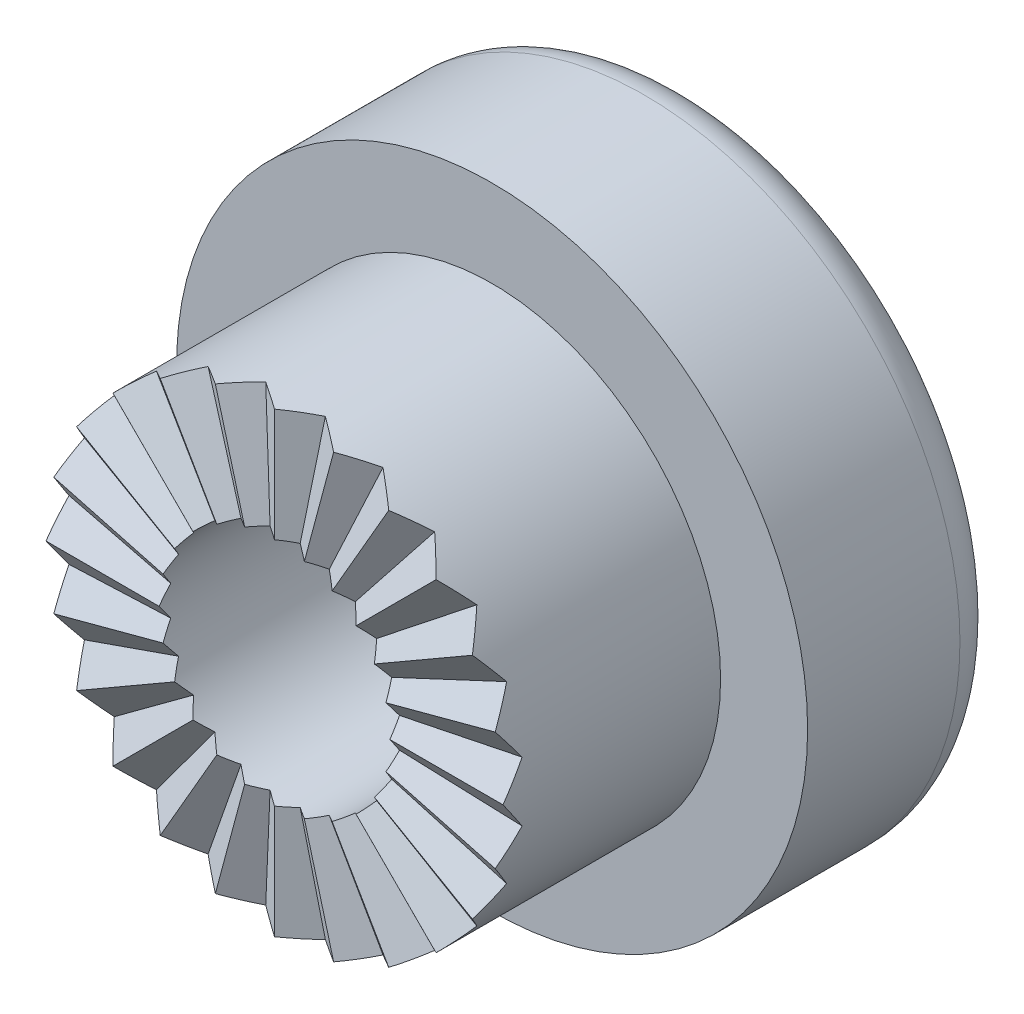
ISO-10303-21;
HEADER;
FILE_DESCRIPTION(('STEP AP214'),'2;1');
FILE_NAME('part.step','',(''),(''),'','','');
FILE_SCHEMA(('AUTOMOTIVE_DESIGN { 1 0 10303 214 1 1 1 1 }'));
ENDSEC;
DATA;
#1=APPLICATION_CONTEXT('core data for automotive mechanical design processes');
#2=APPLICATION_PROTOCOL_DEFINITION('international standard','automotive_design',2000,#1);
#3=PRODUCT_CONTEXT('',#1,'mechanical');
#4=PRODUCT('Part','Part','',(#3));
#5=PRODUCT_RELATED_PRODUCT_CATEGORY('part','',(#4));
#6=PRODUCT_DEFINITION_FORMATION('','',#4);
#7=PRODUCT_DEFINITION_CONTEXT('part definition',#1,'design');
#8=PRODUCT_DEFINITION('design','',#6,#7);
#9=PRODUCT_DEFINITION_SHAPE('','',#8);
#10=(LENGTH_UNIT() NAMED_UNIT(*) SI_UNIT(.MILLI.,.METRE.));
#11=(NAMED_UNIT(*) PLANE_ANGLE_UNIT() SI_UNIT($,.RADIAN.));
#12=(NAMED_UNIT(*) SI_UNIT($,.STERADIAN.) SOLID_ANGLE_UNIT());
#13=UNCERTAINTY_MEASURE_WITH_UNIT(LENGTH_MEASURE(1.E-05),#10,'distance_accuracy_value','');
#14=(GEOMETRIC_REPRESENTATION_CONTEXT(3) GLOBAL_UNCERTAINTY_ASSIGNED_CONTEXT((#13)) GLOBAL_UNIT_ASSIGNED_CONTEXT((#10,
#11,#12)) REPRESENTATION_CONTEXT('',''));
#15=CARTESIAN_POINT('',(0.,0.,0.));
#16=DIRECTION('',(0.,0.,1.));
#17=DIRECTION('',(1.,0.,0.));
#18=AXIS2_PLACEMENT_3D('',#15,#16,#17);
#19=CARTESIAN_POINT('',(0.,0.,5.));
#20=DIRECTION('',(0.,0.,-1.));
#21=DIRECTION('',(-1.,0.,0.));
#22=AXIS2_PLACEMENT_3D('',#19,#20,#21);
#23=CYLINDRICAL_SURFACE('',#22,5.25);
#24=CARTESIAN_POINT('',(0.,0.,0.));
#25=DIRECTION('',(0.,0.,1.));
#26=DIRECTION('',(1.,0.,0.));
#27=AXIS2_PLACEMENT_3D('',#24,#25,#26);
#28=CIRCLE('',#27,5.25);
#29=CARTESIAN_POINT('',(5.25,0.,0.));
#30=VERTEX_POINT('',#29);
#31=EDGE_CURVE('E1044',#30,#30,#28,.T.);
#32=ORIENTED_EDGE('',*,*,#31,.T.);
#33=EDGE_LOOP('',(#32));
#34=FACE_BOUND('',#33,.T.);
#35=CARTESIAN_POINT('',(0.,0.,5.));
#36=DIRECTION('',(0.55722657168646,0.149308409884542,0.816826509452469));
#37=DIRECTION('',(0.788993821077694,0.211410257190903,-0.576883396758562));
#38=AXIS2_PLACEMENT_3D('',#35,#36,#37);
#39=ELLIPSE('',#38,6.42731343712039,5.25);
#40=CARTESIAN_POINT('',(-0.6852625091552,5.20508552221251,4.51603362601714));
#41=VERTEX_POINT('',#40);
#42=CARTESIAN_POINT('',(-1.35879998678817,5.07111058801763,5.));
#43=VERTEX_POINT('',#42);
#44=EDGE_CURVE('E496',#41,#43,#39,.T.);
#45=ORIENTED_EDGE('',*,*,#44,.F.);
#46=CARTESIAN_POINT('',(0.,0.,5.));
#47=DIRECTION('',(-0.576883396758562,0.,0.816826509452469));
#48=DIRECTION('',(-0.816826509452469,0.,-0.576883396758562));
#49=AXIS2_PLACEMENT_3D('',#46,#47,#48);
#50=ELLIPSE('',#49,6.42731343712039,5.25);
#51=CARTESIAN_POINT('',(0.,5.25,4.99999999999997));
#52=VERTEX_POINT('',#51);
#53=EDGE_CURVE('E495',#52,#41,#50,.T.);
#54=ORIENTED_EDGE('',*,*,#53,.F.);
#55=CARTESIAN_POINT('',(0.,0.,5.));
#56=DIRECTION('',(0.576883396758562,0.,0.816826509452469));
#57=DIRECTION('',(0.816826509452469,0.,-0.576883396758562));
#58=AXIS2_PLACEMENT_3D('',#55,#56,#57);
#59=ELLIPSE('',#58,6.42731343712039,5.25);
#60=CARTESIAN_POINT('',(0.685262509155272,5.2050855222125,4.51603362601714));
#61=VERTEX_POINT('',#60);
#62=EDGE_CURVE('E504',#61,#52,#59,.T.);
#63=ORIENTED_EDGE('',*,*,#62,.F.);
#64=CARTESIAN_POINT('',(0.,0.,5.));
#65=DIRECTION('',(-0.557226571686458,0.14930840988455,0.816826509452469));
#66=DIRECTION('',(-0.788993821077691,0.211410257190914,-0.576883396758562));
#67=AXIS2_PLACEMENT_3D('',#64,#65,#66);
#68=ELLIPSE('',#67,6.42731343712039,5.25);
#69=CARTESIAN_POINT('',(1.35879998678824,5.07111058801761,5.));
#70=VERTEX_POINT('',#69);
#71=EDGE_CURVE('E505',#70,#61,#68,.T.);
#72=ORIENTED_EDGE('',*,*,#71,.F.);
#73=CARTESIAN_POINT('',(0.,0.,5.));
#74=DIRECTION('',(0.557226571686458,-0.14930840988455,0.816826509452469));
#75=DIRECTION('',(0.788993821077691,-0.211410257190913,-0.576883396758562));
#76=AXIS2_PLACEMENT_3D('',#73,#74,#75);
#77=ELLIPSE('',#76,6.42731343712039,5.25);
#78=CARTESIAN_POINT('',(2.00908801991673,4.85036754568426,4.51603362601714));
#79=VERTEX_POINT('',#78);
#80=EDGE_CURVE('E201',#79,#70,#77,.T.);
#81=ORIENTED_EDGE('',*,*,#80,.F.);
#82=CARTESIAN_POINT('',(0.,0.,5.));
#83=DIRECTION('',(-0.499595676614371,0.288441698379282,0.816826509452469));
#84=DIRECTION('',(-0.707392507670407,0.408413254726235,-0.576883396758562));
#85=AXIS2_PLACEMENT_3D('',#82,#83,#84);
#86=ELLIPSE('',#85,6.42731343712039,5.25);
#87=CARTESIAN_POINT('',(2.62500000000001,4.5466333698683,5.));
#88=VERTEX_POINT('',#87);
#89=EDGE_CURVE('E1023',#88,#79,#86,.T.);
#90=ORIENTED_EDGE('',*,*,#89,.F.);
#91=CARTESIAN_POINT('',(0.,0.,5.));
#92=DIRECTION('',(0.499595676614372,-0.288441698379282,0.816826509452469));
#93=DIRECTION('',(0.707392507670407,-0.408413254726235,-0.576883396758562));
#94=AXIS2_PLACEMENT_3D('',#91,#92,#93);
#95=ELLIPSE('',#94,6.42731343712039,5.25);
#96=CARTESIAN_POINT('',(3.19599750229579,4.16510503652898,4.51603362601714));
#97=VERTEX_POINT('',#96);
#98=EDGE_CURVE('E1003',#97,#88,#95,.T.);
#99=ORIENTED_EDGE('',*,*,#98,.F.);
#100=CARTESIAN_POINT('',(0.,0.,5.));
#101=DIRECTION('',(-0.407918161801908,0.407918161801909,0.816826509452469));
#102=DIRECTION('',(-0.577583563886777,0.577583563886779,-0.576883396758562));
#103=AXIS2_PLACEMENT_3D('',#100,#101,#102);
#104=ELLIPSE('',#103,6.42731343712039,5.25);
#105=CARTESIAN_POINT('',(3.71231060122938,3.71231060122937,5.));
#106=VERTEX_POINT('',#105);
#107=EDGE_CURVE('E1007',#106,#97,#104,.T.);
#108=ORIENTED_EDGE('',*,*,#107,.F.);
#109=CARTESIAN_POINT('',(0.,0.,5.));
#110=DIRECTION('',(0.407918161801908,-0.407918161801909,0.816826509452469));
#111=DIRECTION('',(0.577583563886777,-0.577583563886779,-0.576883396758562));
#112=AXIS2_PLACEMENT_3D('',#109,#110,#111);
#113=ELLIPSE('',#112,6.42731343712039,5.25);
#114=CARTESIAN_POINT('',(4.16510503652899,3.19599750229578,4.51603362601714));
#115=VERTEX_POINT('',#114);
#116=EDGE_CURVE('E985',#115,#106,#113,.T.);
#117=ORIENTED_EDGE('',*,*,#116,.F.);
#118=CARTESIAN_POINT('',(0.,0.,5.));
#119=DIRECTION('',(-0.28844169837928,0.499595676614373,0.816826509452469));
#120=DIRECTION('',(-0.408413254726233,0.707392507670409,-0.576883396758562));
#121=AXIS2_PLACEMENT_3D('',#118,#119,#120);
#122=ELLIPSE('',#121,6.42731343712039,5.25);
#123=CARTESIAN_POINT('',(4.54663336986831,2.62499999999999,5.));
#124=VERTEX_POINT('',#123);
#125=EDGE_CURVE('E989',#124,#115,#122,.T.);
#126=ORIENTED_EDGE('',*,*,#125,.F.);
#127=CARTESIAN_POINT('',(0.,0.,5.));
#128=DIRECTION('',(0.28844169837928,-0.499595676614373,0.816826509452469));
#129=DIRECTION('',(0.408413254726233,-0.707392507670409,-0.576883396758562));
#130=AXIS2_PLACEMENT_3D('',#127,#128,#129);
#131=ELLIPSE('',#130,6.42731343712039,5.25);
#132=CARTESIAN_POINT('',(4.85036754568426,2.00908801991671,4.51603362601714));
#133=VERTEX_POINT('',#132);
#134=EDGE_CURVE('E967',#133,#124,#131,.T.);
#135=ORIENTED_EDGE('',*,*,#134,.F.);
#136=CARTESIAN_POINT('',(0.,0.,5.));
#137=DIRECTION('',(-0.149308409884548,0.557226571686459,0.816826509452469));
#138=DIRECTION('',(-0.211410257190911,0.788993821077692,-0.576883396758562));
#139=AXIS2_PLACEMENT_3D('',#136,#137,#138);
#140=ELLIPSE('',#139,6.42731343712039,5.25);
#141=CARTESIAN_POINT('',(5.07111058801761,1.35879998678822,5.));
#142=VERTEX_POINT('',#141);
#143=EDGE_CURVE('E971',#142,#133,#140,.T.);
#144=ORIENTED_EDGE('',*,*,#143,.F.);
#145=CARTESIAN_POINT('',(0.,0.,5.));
#146=DIRECTION('',(0.149308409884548,-0.557226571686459,0.816826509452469));
#147=DIRECTION('',(0.211410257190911,-0.788993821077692,-0.576883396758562));
#148=AXIS2_PLACEMENT_3D('',#145,#146,#147);
#149=ELLIPSE('',#148,6.42731343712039,5.25);
#150=CARTESIAN_POINT('',(5.2050855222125,0.685262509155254,4.51603362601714));
#151=VERTEX_POINT('',#150);
#152=EDGE_CURVE('E949',#151,#142,#149,.T.);
#153=ORIENTED_EDGE('',*,*,#152,.F.);
#154=CARTESIAN_POINT('',(0.,0.,5.));
#155=DIRECTION('',(0.,0.576883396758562,0.816826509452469));
#156=DIRECTION('',(0.,0.816826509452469,-0.576883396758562));
#157=AXIS2_PLACEMENT_3D('',#154,#155,#156);
#158=ELLIPSE('',#157,6.42731343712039,5.25);
#159=CARTESIAN_POINT('',(5.25,0.,5.));
#160=VERTEX_POINT('',#159);
#161=EDGE_CURVE('E953',#160,#151,#158,.T.);
#162=ORIENTED_EDGE('',*,*,#161,.F.);
#163=CARTESIAN_POINT('',(0.,0.,5.));
#164=DIRECTION('',(0.,-0.576883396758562,0.816826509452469));
#165=DIRECTION('',(0.,-0.816826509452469,-0.576883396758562));
#166=AXIS2_PLACEMENT_3D('',#163,#164,#165);
#167=ELLIPSE('',#166,6.42731343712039,5.25);
#168=CARTESIAN_POINT('',(5.2050855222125,-0.685262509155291,4.51603362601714));
#169=VERTEX_POINT('',#168);
#170=EDGE_CURVE('E931',#169,#160,#167,.T.);
#171=ORIENTED_EDGE('',*,*,#170,.F.);
#172=CARTESIAN_POINT('',(0.,0.,5.));
#173=DIRECTION('',(0.149308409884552,0.557226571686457,0.816826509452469));
#174=DIRECTION('',(0.211410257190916,0.78899382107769,-0.576883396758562));
#175=AXIS2_PLACEMENT_3D('',#172,#173,#174);
#176=ELLIPSE('',#175,6.42731343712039,5.25);
#177=CARTESIAN_POINT('',(5.0711105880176,-1.35879998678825,5.));
#178=VERTEX_POINT('',#177);
#179=EDGE_CURVE('E935',#178,#169,#176,.T.);
#180=ORIENTED_EDGE('',*,*,#179,.F.);
#181=CARTESIAN_POINT('',(0.,0.,5.));
#182=DIRECTION('',(-0.149308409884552,-0.557226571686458,0.816826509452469));
#183=DIRECTION('',(-0.211410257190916,-0.78899382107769,-0.576883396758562));
#184=AXIS2_PLACEMENT_3D('',#181,#182,#183);
#185=ELLIPSE('',#184,6.42731343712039,5.25);
#186=CARTESIAN_POINT('',(4.85036754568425,-2.00908801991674,4.51603362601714));
#187=VERTEX_POINT('',#186);
#188=EDGE_CURVE('E913',#187,#178,#185,.T.);
#189=ORIENTED_EDGE('',*,*,#188,.F.);
#190=CARTESIAN_POINT('',(0.,0.,5.));
#191=DIRECTION('',(0.288441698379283,0.499595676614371,0.816826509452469));
#192=DIRECTION('',(0.408413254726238,0.707392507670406,-0.576883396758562));
#193=AXIS2_PLACEMENT_3D('',#190,#191,#192);
#194=ELLIPSE('',#193,6.42731343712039,5.25);
#195=CARTESIAN_POINT('',(4.54663336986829,-2.62500000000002,5.));
#196=VERTEX_POINT('',#195);
#197=EDGE_CURVE('E917',#196,#187,#194,.T.);
#198=ORIENTED_EDGE('',*,*,#197,.F.);
#199=CARTESIAN_POINT('',(0.,0.,5.));
#200=DIRECTION('',(-0.288441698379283,-0.499595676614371,0.816826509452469));
#201=DIRECTION('',(-0.408413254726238,-0.707392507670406,-0.576883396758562));
#202=AXIS2_PLACEMENT_3D('',#199,#200,#201);
#203=ELLIPSE('',#202,6.42731343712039,5.25);
#204=CARTESIAN_POINT('',(4.16510503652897,-3.1959975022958,4.51603362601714));
#205=VERTEX_POINT('',#204);
#206=EDGE_CURVE('E895',#205,#196,#203,.T.);
#207=ORIENTED_EDGE('',*,*,#206,.F.);
#208=CARTESIAN_POINT('',(0.,0.,5.));
#209=DIRECTION('',(0.407918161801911,0.407918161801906,0.816826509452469));
#210=DIRECTION('',(0.577583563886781,0.577583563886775,-0.576883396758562));
#211=AXIS2_PLACEMENT_3D('',#208,#209,#210);
#212=ELLIPSE('',#211,6.42731343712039,5.25);
#213=CARTESIAN_POINT('',(3.71231060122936,-3.7123106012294,5.));
#214=VERTEX_POINT('',#213);
#215=EDGE_CURVE('E899',#214,#205,#212,.T.);
#216=ORIENTED_EDGE('',*,*,#215,.F.);
#217=CARTESIAN_POINT('',(0.,0.,5.));
#218=DIRECTION('',(-0.407918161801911,-0.407918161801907,0.816826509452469));
#219=DIRECTION('',(-0.577583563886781,-0.577583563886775,-0.576883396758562));
#220=AXIS2_PLACEMENT_3D('',#217,#218,#219);
#221=ELLIPSE('',#220,6.42731343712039,5.25);
#222=CARTESIAN_POINT('',(3.19599750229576,-4.165105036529,4.51603362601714));
#223=VERTEX_POINT('',#222);
#224=EDGE_CURVE('E877',#223,#214,#221,.T.);
#225=ORIENTED_EDGE('',*,*,#224,.F.);
#226=CARTESIAN_POINT('',(0.,0.,5.));
#227=DIRECTION('',(0.499595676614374,0.288441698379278,0.816826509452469));
#228=DIRECTION('',(0.70739250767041,0.40841325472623,-0.576883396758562));
#229=AXIS2_PLACEMENT_3D('',#226,#227,#228);
#230=ELLIPSE('',#229,6.42731343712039,5.25);
#231=CARTESIAN_POINT('',(2.62499999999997,-4.54663336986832,5.));
#232=VERTEX_POINT('',#231);
#233=EDGE_CURVE('E881',#232,#223,#230,.T.);
#234=ORIENTED_EDGE('',*,*,#233,.F.);
#235=CARTESIAN_POINT('',(0.,0.,5.));
#236=DIRECTION('',(-0.499595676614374,-0.288441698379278,0.816826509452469));
#237=DIRECTION('',(-0.70739250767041,-0.40841325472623,-0.576883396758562));
#238=AXIS2_PLACEMENT_3D('',#235,#236,#237);
#239=ELLIPSE('',#238,6.42731343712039,5.25);
#240=CARTESIAN_POINT('',(2.00908801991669,-4.85036754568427,4.51603362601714));
#241=VERTEX_POINT('',#240);
#242=EDGE_CURVE('E859',#241,#232,#239,.T.);
#243=ORIENTED_EDGE('',*,*,#242,.F.);
#244=CARTESIAN_POINT('',(0.,0.,5.));
#245=DIRECTION('',(0.557226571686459,0.149308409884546,0.816826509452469));
#246=DIRECTION('',(0.788993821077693,0.211410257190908,-0.576883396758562));
#247=AXIS2_PLACEMENT_3D('',#244,#245,#246);
#248=ELLIPSE('',#247,6.42731343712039,5.25);
#249=CARTESIAN_POINT('',(1.3587999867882,-5.07111058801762,5.));
#250=VERTEX_POINT('',#249);
#251=EDGE_CURVE('E863',#250,#241,#248,.T.);
#252=ORIENTED_EDGE('',*,*,#251,.F.);
#253=CARTESIAN_POINT('',(0.,0.,5.));
#254=DIRECTION('',(-0.557226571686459,-0.149308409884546,0.816826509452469));
#255=DIRECTION('',(-0.788993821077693,-0.211410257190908,-0.576883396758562));
#256=AXIS2_PLACEMENT_3D('',#253,#254,#255);
#257=ELLIPSE('',#256,6.42731343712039,5.25);
#258=CARTESIAN_POINT('',(0.685262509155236,-5.20508552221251,4.51603362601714));
#259=VERTEX_POINT('',#258);
#260=EDGE_CURVE('E841',#259,#250,#257,.T.);
#261=ORIENTED_EDGE('',*,*,#260,.F.);
#262=CARTESIAN_POINT('',(0.,0.,5.));
#263=DIRECTION('',(0.576883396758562,0.,0.816826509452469));
#264=DIRECTION('',(0.816826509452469,0.,-0.576883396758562));
#265=AXIS2_PLACEMENT_3D('',#262,#263,#264);
#266=ELLIPSE('',#265,6.42731343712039,5.25);
#267=CARTESIAN_POINT('',(0.,-5.25,5.));
#268=VERTEX_POINT('',#267);
#269=EDGE_CURVE('E845',#268,#259,#266,.T.);
#270=ORIENTED_EDGE('',*,*,#269,.F.);
#271=CARTESIAN_POINT('',(0.,0.,5.));
#272=DIRECTION('',(-0.576883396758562,0.,0.816826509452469));
#273=DIRECTION('',(-0.816826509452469,0.,-0.576883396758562));
#274=AXIS2_PLACEMENT_3D('',#271,#272,#273);
#275=ELLIPSE('',#274,6.42731343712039,5.25);
#276=CARTESIAN_POINT('',(-0.685262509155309,-5.2050855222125,4.51603362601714));
#277=VERTEX_POINT('',#276);
#278=EDGE_CURVE('E823',#277,#268,#275,.T.);
#279=ORIENTED_EDGE('',*,*,#278,.F.);
#280=CARTESIAN_POINT('',(0.,0.,5.));
#281=DIRECTION('',(0.557226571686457,-0.149308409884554,0.816826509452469));
#282=DIRECTION('',(0.78899382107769,-0.211410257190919,-0.576883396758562));
#283=AXIS2_PLACEMENT_3D('',#280,#281,#282);
#284=ELLIPSE('',#283,6.42731343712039,5.25);
#285=CARTESIAN_POINT('',(-1.35879998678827,-5.0711105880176,5.));
#286=VERTEX_POINT('',#285);
#287=EDGE_CURVE('E827',#286,#277,#284,.T.);
#288=ORIENTED_EDGE('',*,*,#287,.F.);
#289=CARTESIAN_POINT('',(0.,0.,5.));
#290=DIRECTION('',(-0.557226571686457,0.149308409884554,0.816826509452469));
#291=DIRECTION('',(-0.78899382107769,0.211410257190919,-0.576883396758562));
#292=AXIS2_PLACEMENT_3D('',#289,#290,#291);
#293=ELLIPSE('',#292,6.42731343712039,5.25);
#294=CARTESIAN_POINT('',(-2.00908801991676,-4.85036754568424,4.51603362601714));
#295=VERTEX_POINT('',#294);
#296=EDGE_CURVE('E805',#295,#286,#293,.T.);
#297=ORIENTED_EDGE('',*,*,#296,.F.);
#298=CARTESIAN_POINT('',(0.,0.,5.));
#299=DIRECTION('',(0.499595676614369,-0.288441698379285,0.816826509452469));
#300=DIRECTION('',(0.707392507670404,-0.40841325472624,-0.576883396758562));
#301=AXIS2_PLACEMENT_3D('',#298,#299,#300);
#302=ELLIPSE('',#301,6.42731343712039,5.25);
#303=CARTESIAN_POINT('',(-2.62500000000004,-4.54663336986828,5.));
#304=VERTEX_POINT('',#303);
#305=EDGE_CURVE('E809',#304,#295,#302,.T.);
#306=ORIENTED_EDGE('',*,*,#305,.F.);
#307=CARTESIAN_POINT('',(0.,0.,5.));
#308=DIRECTION('',(-0.49959567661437,0.288441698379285,0.816826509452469));
#309=DIRECTION('',(-0.707392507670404,0.40841325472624,-0.576883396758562));
#310=AXIS2_PLACEMENT_3D('',#307,#308,#309);
#311=ELLIPSE('',#310,6.42731343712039,5.25);
#312=CARTESIAN_POINT('',(-3.19599750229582,-4.16510503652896,4.51603362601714));
#313=VERTEX_POINT('',#312);
#314=EDGE_CURVE('E787',#313,#304,#311,.T.);
#315=ORIENTED_EDGE('',*,*,#314,.F.);
#316=CARTESIAN_POINT('',(0.,0.,5.));
#317=DIRECTION('',(0.407918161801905,-0.407918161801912,0.816826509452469));
#318=DIRECTION('',(0.577583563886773,-0.577583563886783,-0.576883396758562));
#319=AXIS2_PLACEMENT_3D('',#316,#317,#318);
#320=ELLIPSE('',#319,6.42731343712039,5.25);
#321=CARTESIAN_POINT('',(-3.71231060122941,-3.71231060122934,5.));
#322=VERTEX_POINT('',#321);
#323=EDGE_CURVE('E791',#322,#313,#320,.T.);
#324=ORIENTED_EDGE('',*,*,#323,.F.);
#325=CARTESIAN_POINT('',(0.,0.,5.));
#326=DIRECTION('',(-0.407918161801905,0.407918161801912,0.816826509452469));
#327=DIRECTION('',(-0.577583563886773,0.577583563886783,-0.576883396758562));
#328=AXIS2_PLACEMENT_3D('',#325,#326,#327);
#329=ELLIPSE('',#328,6.42731343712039,5.25);
#330=CARTESIAN_POINT('',(-4.16510503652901,-3.19599750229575,4.51603362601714));
#331=VERTEX_POINT('',#330);
#332=EDGE_CURVE('E769',#331,#322,#329,.T.);
#333=ORIENTED_EDGE('',*,*,#332,.F.);
#334=CARTESIAN_POINT('',(0.,0.,5.));
#335=DIRECTION('',(0.288441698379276,-0.499595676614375,0.816826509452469));
#336=DIRECTION('',(0.408413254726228,-0.707392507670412,-0.576883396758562));
#337=AXIS2_PLACEMENT_3D('',#334,#335,#336);
#338=ELLIPSE('',#337,6.42731343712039,5.25);
#339=CARTESIAN_POINT('',(-4.54663336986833,-2.62499999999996,5.));
#340=VERTEX_POINT('',#339);
#341=EDGE_CURVE('E773',#340,#331,#338,.T.);
#342=ORIENTED_EDGE('',*,*,#341,.F.);
#343=CARTESIAN_POINT('',(0.,0.,5.));
#344=DIRECTION('',(-0.288441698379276,0.499595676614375,0.816826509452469));
#345=DIRECTION('',(-0.408413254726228,0.707392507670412,-0.576883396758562));
#346=AXIS2_PLACEMENT_3D('',#343,#344,#345);
#347=ELLIPSE('',#346,6.42731343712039,5.25);
#348=CARTESIAN_POINT('',(-4.85036754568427,-2.00908801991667,4.51603362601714));
#349=VERTEX_POINT('',#348);
#350=EDGE_CURVE('E751',#349,#340,#347,.T.);
#351=ORIENTED_EDGE('',*,*,#350,.F.);
#352=CARTESIAN_POINT('',(0.,0.,5.));
#353=DIRECTION('',(0.149308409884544,-0.55722657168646,0.816826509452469));
#354=DIRECTION('',(0.211410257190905,-0.788993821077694,-0.576883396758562));
#355=AXIS2_PLACEMENT_3D('',#352,#353,#354);
#356=ELLIPSE('',#355,6.42731343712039,5.25);
#357=CARTESIAN_POINT('',(-5.07111058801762,-1.35879998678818,5.));
#358=VERTEX_POINT('',#357);
#359=EDGE_CURVE('E755',#358,#349,#356,.T.);
#360=ORIENTED_EDGE('',*,*,#359,.F.);
#361=CARTESIAN_POINT('',(0.,0.,5.));
#362=DIRECTION('',(-0.149308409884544,0.55722657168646,0.816826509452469));
#363=DIRECTION('',(-0.211410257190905,0.788993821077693,-0.576883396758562));
#364=AXIS2_PLACEMENT_3D('',#361,#362,#363);
#365=ELLIPSE('',#364,6.42731343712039,5.25);
#366=CARTESIAN_POINT('',(-5.20508552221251,-0.685262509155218,4.51603362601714));
#367=VERTEX_POINT('',#366);
#368=EDGE_CURVE('E733',#367,#358,#365,.T.);
#369=ORIENTED_EDGE('',*,*,#368,.F.);
#370=CARTESIAN_POINT('',(0.,0.,5.));
#371=DIRECTION('',(0.,-0.576883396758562,0.816826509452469));
#372=DIRECTION('',(0.,-0.816826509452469,-0.576883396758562));
#373=AXIS2_PLACEMENT_3D('',#370,#371,#372);
#374=ELLIPSE('',#373,6.42731343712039,5.25);
#375=CARTESIAN_POINT('',(-5.25,0.,5.));
#376=VERTEX_POINT('',#375);
#377=EDGE_CURVE('E737',#376,#367,#374,.T.);
#378=ORIENTED_EDGE('',*,*,#377,.F.);
#379=CARTESIAN_POINT('',(0.,0.,5.));
#380=DIRECTION('',(0.,0.576883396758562,0.816826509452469));
#381=DIRECTION('',(0.,0.816826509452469,-0.576883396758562));
#382=AXIS2_PLACEMENT_3D('',#379,#380,#381);
#383=ELLIPSE('',#382,6.42731343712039,5.25);
#384=CARTESIAN_POINT('',(-5.2050855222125,0.685262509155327,4.51603362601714));
#385=VERTEX_POINT('',#384);
#386=EDGE_CURVE('E715',#385,#376,#383,.T.);
#387=ORIENTED_EDGE('',*,*,#386,.F.);
#388=CARTESIAN_POINT('',(0.,0.,5.));
#389=DIRECTION('',(-0.149308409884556,-0.557226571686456,0.816826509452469));
#390=DIRECTION('',(-0.211410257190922,-0.788993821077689,-0.576883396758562));
#391=AXIS2_PLACEMENT_3D('',#388,#389,#390);
#392=ELLIPSE('',#391,6.42731343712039,5.25);
#393=CARTESIAN_POINT('',(-5.07111058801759,1.35879998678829,5.));
#394=VERTEX_POINT('',#393);
#395=EDGE_CURVE('E719',#394,#385,#392,.T.);
#396=ORIENTED_EDGE('',*,*,#395,.F.);
#397=CARTESIAN_POINT('',(0.,0.,5.));
#398=DIRECTION('',(0.149308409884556,0.557226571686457,0.816826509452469));
#399=DIRECTION('',(0.211410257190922,0.788993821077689,-0.576883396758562));
#400=AXIS2_PLACEMENT_3D('',#397,#398,#399);
#401=ELLIPSE('',#400,6.42731343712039,5.25);
#402=CARTESIAN_POINT('',(-4.85036754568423,2.00908801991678,4.51603362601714));
#403=VERTEX_POINT('',#402);
#404=EDGE_CURVE('E697',#403,#394,#401,.T.);
#405=ORIENTED_EDGE('',*,*,#404,.F.);
#406=CARTESIAN_POINT('',(0.,0.,5.));
#407=DIRECTION('',(-0.288441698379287,-0.499595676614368,0.816826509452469));
#408=DIRECTION('',(-0.408413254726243,-0.707392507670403,-0.576883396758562));
#409=AXIS2_PLACEMENT_3D('',#406,#407,#408);
#410=ELLIPSE('',#409,6.42731343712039,5.25);
#411=CARTESIAN_POINT('',(-4.54663336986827,2.62500000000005,5.));
#412=VERTEX_POINT('',#411);
#413=EDGE_CURVE('E701',#412,#403,#410,.T.);
#414=ORIENTED_EDGE('',*,*,#413,.F.);
#415=CARTESIAN_POINT('',(0.,0.,5.));
#416=DIRECTION('',(0.288441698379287,0.499595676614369,0.816826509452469));
#417=DIRECTION('',(0.408413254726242,0.707392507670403,-0.576883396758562));
#418=AXIS2_PLACEMENT_3D('',#415,#416,#417);
#419=ELLIPSE('',#418,6.42731343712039,5.25);
#420=CARTESIAN_POINT('',(-4.16510503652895,3.19599750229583,4.51603362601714));
#421=VERTEX_POINT('',#420);
#422=EDGE_CURVE('E679',#421,#412,#419,.T.);
#423=ORIENTED_EDGE('',*,*,#422,.F.);
#424=CARTESIAN_POINT('',(0.,0.,5.));
#425=DIRECTION('',(-0.407918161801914,-0.407918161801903,0.816826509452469));
#426=DIRECTION('',(-0.577583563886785,-0.577583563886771,-0.576883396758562));
#427=AXIS2_PLACEMENT_3D('',#424,#425,#426);
#428=ELLIPSE('',#427,6.42731343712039,5.25);
#429=CARTESIAN_POINT('',(-3.71231060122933,3.71231060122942,5.));
#430=VERTEX_POINT('',#429);
#431=EDGE_CURVE('E683',#430,#421,#428,.T.);
#432=ORIENTED_EDGE('',*,*,#431,.F.);
#433=CARTESIAN_POINT('',(0.,0.,5.));
#434=DIRECTION('',(0.407918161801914,0.407918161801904,0.816826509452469));
#435=DIRECTION('',(0.577583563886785,0.577583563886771,-0.576883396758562));
#436=AXIS2_PLACEMENT_3D('',#433,#434,#435);
#437=ELLIPSE('',#436,6.42731343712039,5.25);
#438=CARTESIAN_POINT('',(-3.19599750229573,4.16510503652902,4.51603362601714));
#439=VERTEX_POINT('',#438);
#440=EDGE_CURVE('E661',#439,#430,#437,.T.);
#441=ORIENTED_EDGE('',*,*,#440,.F.);
#442=CARTESIAN_POINT('',(0.,0.,5.));
#443=DIRECTION('',(-0.499595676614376,-0.288441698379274,0.816826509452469));
#444=DIRECTION('',(-0.707392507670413,-0.408413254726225,-0.576883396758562));
#445=AXIS2_PLACEMENT_3D('',#442,#443,#444);
#446=ELLIPSE('',#445,6.42731343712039,5.25);
#447=CARTESIAN_POINT('',(-2.62499999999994,4.54663336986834,5.));
#448=VERTEX_POINT('',#447);
#449=EDGE_CURVE('E665',#448,#439,#446,.T.);
#450=ORIENTED_EDGE('',*,*,#449,.F.);
#451=CARTESIAN_POINT('',(0.,0.,5.));
#452=DIRECTION('',(0.499595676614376,0.288441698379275,0.816826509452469));
#453=DIRECTION('',(0.707392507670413,0.408413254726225,-0.576883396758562));
#454=AXIS2_PLACEMENT_3D('',#451,#452,#453);
#455=ELLIPSE('',#454,6.42731343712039,5.25);
#456=CARTESIAN_POINT('',(-2.00908801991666,4.85036754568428,4.51603362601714));
#457=VERTEX_POINT('',#456);
#458=EDGE_CURVE('E640',#457,#448,#455,.T.);
#459=ORIENTED_EDGE('',*,*,#458,.F.);
#460=CARTESIAN_POINT('',(0.,0.,5.));
#461=DIRECTION('',(-0.55722657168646,-0.149308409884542,0.816826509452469));
#462=DIRECTION('',(-0.788993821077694,-0.211410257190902,-0.576883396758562));
#463=AXIS2_PLACEMENT_3D('',#460,#461,#462);
#464=ELLIPSE('',#463,6.42731343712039,5.25);
#465=EDGE_CURVE('E643',#43,#457,#464,.T.);
#466=ORIENTED_EDGE('',*,*,#465,.F.);
#467=EDGE_LOOP('',(#45,#54,#63,#72,#81,#90,#99,#108,#117,#126,#135,#144,#153,#162,#171,#180,
#189,#198,#207,#216,#225,#234,#243,#252,#261,#270,#279,#288,#297,#306,#315,#324,#333,#342,#351,
#360,#369,#378,#387,#396,#405,#414,#423,#432,#441,#450,#459,#466));
#468=FACE_BOUND('',#467,.T.);
#469=ADVANCED_FACE('F177',(#34,#468),#23,.T.);
#470=CARTESIAN_POINT('',(0.,0.,-4.5));
#471=DIRECTION('',(0.,0.,-1.));
#472=DIRECTION('',(-1.,0.,0.));
#473=AXIS2_PLACEMENT_3D('',#470,#471,#472);
#474=CYLINDRICAL_SURFACE('',#473,2.65000000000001);
#475=CARTESIAN_POINT('',(0.,0.,-2.));
#476=DIRECTION('',(0.,0.,-1.));
#477=DIRECTION('',(-1.,0.,0.));
#478=AXIS2_PLACEMENT_3D('',#475,#476,#477);
#479=CIRCLE('',#478,2.65000000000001);
#480=CARTESIAN_POINT('',(-2.65000000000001,0.,-2.));
#481=VERTEX_POINT('',#480);
#482=EDGE_CURVE('E1041',#481,#481,#479,.T.);
#483=ORIENTED_EDGE('',*,*,#482,.T.);
#484=EDGE_LOOP('',(#483));
#485=FACE_BOUND('',#484,.T.);
#486=CARTESIAN_POINT('',(0.,0.,5.));
#487=DIRECTION('',(0.55722657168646,0.149308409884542,0.816826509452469));
#488=DIRECTION('',(0.788993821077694,0.211410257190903,-0.576883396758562));
#489=AXIS2_PLACEMENT_3D('',#486,#487,#488);
#490=ELLIPSE('',#489,3.24426297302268,2.65000000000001);
#491=CARTESIAN_POINT('',(-0.685870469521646,2.55970343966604,5.));
#492=VERTEX_POINT('',#491);
#493=CARTESIAN_POINT('',(-0.345894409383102,2.62732888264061,4.7557122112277));
#494=VERTEX_POINT('',#493);
#495=EDGE_CURVE('E1082',#492,#494,#490,.F.);
#496=ORIENTED_EDGE('',*,*,#495,.F.);
#497=CARTESIAN_POINT('',(0.,0.,5.));
#498=DIRECTION('',(-0.55722657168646,-0.149308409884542,0.816826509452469));
#499=DIRECTION('',(-0.788993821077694,-0.211410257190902,-0.576883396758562));
#500=AXIS2_PLACEMENT_3D('',#497,#498,#499);
#501=ELLIPSE('',#500,3.24426297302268,2.65000000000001);
#502=CARTESIAN_POINT('',(-1.01411109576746,2.44828076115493,4.7557122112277));
#503=VERTEX_POINT('',#502);
#504=EDGE_CURVE('E12',#503,#492,#501,.F.);
#505=ORIENTED_EDGE('',*,*,#504,.F.);
#506=CARTESIAN_POINT('',(0.,0.,5.));
#507=DIRECTION('',(0.499595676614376,0.288441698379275,0.816826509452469));
#508=DIRECTION('',(0.707392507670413,0.408413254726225,-0.576883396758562));
#509=AXIS2_PLACEMENT_3D('',#506,#507,#508);
#510=ELLIPSE('',#509,3.24426297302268,2.65000000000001);
#511=CARTESIAN_POINT('',(-1.32499999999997,2.29496732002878,5.));
#512=VERTEX_POINT('',#511);
#513=EDGE_CURVE('E636',#512,#503,#510,.F.);
#514=ORIENTED_EDGE('',*,*,#513,.F.);
#515=CARTESIAN_POINT('',(0.,0.,5.));
#516=DIRECTION('',(-0.499595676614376,-0.288441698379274,0.816826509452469));
#517=DIRECTION('',(-0.707392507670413,-0.408413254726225,-0.576883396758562));
#518=AXIS2_PLACEMENT_3D('',#515,#516,#517);
#519=ELLIPSE('',#518,3.24426297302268,2.65000000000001);
#520=CARTESIAN_POINT('',(-1.61321778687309,2.1023863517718,4.7557122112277));
#521=VERTEX_POINT('',#520);
#522=EDGE_CURVE('E186',#521,#512,#519,.F.);
#523=ORIENTED_EDGE('',*,*,#522,.F.);
#524=CARTESIAN_POINT('',(0.,0.,5.));
#525=DIRECTION('',(0.407918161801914,0.407918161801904,0.816826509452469));
#526=DIRECTION('',(0.577583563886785,0.577583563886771,-0.576883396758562));
#527=AXIS2_PLACEMENT_3D('',#524,#525,#526);
#528=ELLIPSE('',#527,3.24426297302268,2.65000000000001);
#529=CARTESIAN_POINT('',(-1.87383297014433,1.87383297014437,5.));
#530=VERTEX_POINT('',#529);
#531=EDGE_CURVE('E634',#530,#521,#528,.F.);
#532=ORIENTED_EDGE('',*,*,#531,.F.);
#533=CARTESIAN_POINT('',(0.,0.,5.));
#534=DIRECTION('',(-0.407918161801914,-0.407918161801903,0.816826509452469));
#535=DIRECTION('',(-0.577583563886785,-0.577583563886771,-0.576883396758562));
#536=AXIS2_PLACEMENT_3D('',#533,#534,#535);
#537=ELLIPSE('',#536,3.24426297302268,2.65000000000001);
#538=CARTESIAN_POINT('',(-2.10238635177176,1.61321778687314,4.7557122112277));
#539=VERTEX_POINT('',#538);
#540=EDGE_CURVE('E612',#539,#530,#537,.F.);
#541=ORIENTED_EDGE('',*,*,#540,.F.);
#542=CARTESIAN_POINT('',(0.,0.,5.));
#543=DIRECTION('',(0.288441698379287,0.499595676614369,0.816826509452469));
#544=DIRECTION('',(0.408413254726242,0.707392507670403,-0.576883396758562));
#545=AXIS2_PLACEMENT_3D('',#542,#543,#544);
#546=ELLIPSE('',#545,3.24426297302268,2.65000000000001);
#547=CARTESIAN_POINT('',(-2.29496732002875,1.32500000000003,5.));
#548=VERTEX_POINT('',#547);
#549=EDGE_CURVE('E671',#548,#539,#546,.F.);
#550=ORIENTED_EDGE('',*,*,#549,.F.);
#551=CARTESIAN_POINT('',(0.,0.,5.));
#552=DIRECTION('',(-0.288441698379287,-0.499595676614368,0.816826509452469));
#553=DIRECTION('',(-0.408413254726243,-0.707392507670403,-0.576883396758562));
#554=AXIS2_PLACEMENT_3D('',#551,#552,#553);
#555=ELLIPSE('',#554,3.24426297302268,2.65000000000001);
#556=CARTESIAN_POINT('',(-2.44828076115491,1.01411109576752,4.7557122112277));
#557=VERTEX_POINT('',#556);
#558=EDGE_CURVE('E607',#557,#548,#555,.F.);
#559=ORIENTED_EDGE('',*,*,#558,.F.);
#560=CARTESIAN_POINT('',(0.,0.,5.));
#561=DIRECTION('',(0.149308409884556,0.557226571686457,0.816826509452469));
#562=DIRECTION('',(0.211410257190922,0.788993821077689,-0.576883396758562));
#563=AXIS2_PLACEMENT_3D('',#560,#561,#562);
#564=ELLIPSE('',#563,3.24426297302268,2.65000000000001);
#565=CARTESIAN_POINT('',(-2.55970343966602,0.685870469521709,5.));
#566=VERTEX_POINT('',#565);
#567=EDGE_CURVE('E689',#566,#557,#564,.F.);
#568=ORIENTED_EDGE('',*,*,#567,.F.);
#569=CARTESIAN_POINT('',(0.,0.,5.));
#570=DIRECTION('',(-0.149308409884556,-0.557226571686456,0.816826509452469));
#571=DIRECTION('',(-0.211410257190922,-0.788993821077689,-0.576883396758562));
#572=AXIS2_PLACEMENT_3D('',#569,#570,#571);
#573=ELLIPSE('',#572,3.24426297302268,2.65000000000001);
#574=CARTESIAN_POINT('',(-2.6273288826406,0.345894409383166,4.7557122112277));
#575=VERTEX_POINT('',#574);
#576=EDGE_CURVE('E602',#575,#566,#573,.F.);
#577=ORIENTED_EDGE('',*,*,#576,.F.);
#578=CARTESIAN_POINT('',(0.,0.,5.));
#579=DIRECTION('',(0.,0.576883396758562,0.816826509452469));
#580=DIRECTION('',(0.,0.816826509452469,-0.576883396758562));
#581=AXIS2_PLACEMENT_3D('',#578,#579,#580);
#582=ELLIPSE('',#581,3.24426297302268,2.65000000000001);
#583=CARTESIAN_POINT('',(-2.65,0.,5.));
#584=VERTEX_POINT('',#583);
#585=EDGE_CURVE('E707',#584,#575,#582,.F.);
#586=ORIENTED_EDGE('',*,*,#585,.F.);
#587=CARTESIAN_POINT('',(0.,0.,5.));
#588=DIRECTION('',(0.,-0.576883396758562,0.816826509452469));
#589=DIRECTION('',(0.,-0.816826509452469,-0.576883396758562));
#590=AXIS2_PLACEMENT_3D('',#587,#588,#589);
#591=ELLIPSE('',#590,3.24426297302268,2.65000000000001);
#592=CARTESIAN_POINT('',(-2.62732888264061,-0.345894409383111,4.7557122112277));
#593=VERTEX_POINT('',#592);
#594=EDGE_CURVE('E597',#593,#584,#591,.F.);
#595=ORIENTED_EDGE('',*,*,#594,.F.);
#596=CARTESIAN_POINT('',(0.,0.,5.));
#597=DIRECTION('',(-0.149308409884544,0.55722657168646,0.816826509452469));
#598=DIRECTION('',(-0.211410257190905,0.788993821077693,-0.576883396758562));
#599=AXIS2_PLACEMENT_3D('',#596,#597,#598);
#600=ELLIPSE('',#599,3.24426297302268,2.65000000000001);
#601=CARTESIAN_POINT('',(-2.55970343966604,-0.685870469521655,5.));
#602=VERTEX_POINT('',#601);
#603=EDGE_CURVE('E725',#602,#593,#600,.F.);
#604=ORIENTED_EDGE('',*,*,#603,.F.);
#605=CARTESIAN_POINT('',(0.,0.,5.));
#606=DIRECTION('',(0.149308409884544,-0.55722657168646,0.816826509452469));
#607=DIRECTION('',(0.211410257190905,-0.788993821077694,-0.576883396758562));
#608=AXIS2_PLACEMENT_3D('',#605,#606,#607);
#609=ELLIPSE('',#608,3.24426297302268,2.65000000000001);
#610=CARTESIAN_POINT('',(-2.44828076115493,-1.01411109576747,4.7557122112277));
#611=VERTEX_POINT('',#610);
#612=EDGE_CURVE('E592',#611,#602,#609,.F.);
#613=ORIENTED_EDGE('',*,*,#612,.F.);
#614=CARTESIAN_POINT('',(0.,0.,5.));
#615=DIRECTION('',(-0.288441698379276,0.499595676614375,0.816826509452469));
#616=DIRECTION('',(-0.408413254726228,0.707392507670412,-0.576883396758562));
#617=AXIS2_PLACEMENT_3D('',#614,#615,#616);
#618=ELLIPSE('',#617,3.24426297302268,2.65000000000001);
#619=CARTESIAN_POINT('',(-2.29496732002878,-1.32499999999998,5.));
#620=VERTEX_POINT('',#619);
#621=EDGE_CURVE('E743',#620,#611,#618,.F.);
#622=ORIENTED_EDGE('',*,*,#621,.F.);
#623=CARTESIAN_POINT('',(0.,0.,5.));
#624=DIRECTION('',(0.288441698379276,-0.499595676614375,0.816826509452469));
#625=DIRECTION('',(0.408413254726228,-0.707392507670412,-0.576883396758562));
#626=AXIS2_PLACEMENT_3D('',#623,#624,#625);
#627=ELLIPSE('',#626,3.24426297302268,2.65000000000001);
#628=CARTESIAN_POINT('',(-2.10238635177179,-1.6132177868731,4.7557122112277));
#629=VERTEX_POINT('',#628);
#630=EDGE_CURVE('E587',#629,#620,#627,.F.);
#631=ORIENTED_EDGE('',*,*,#630,.F.);
#632=CARTESIAN_POINT('',(0.,0.,5.));
#633=DIRECTION('',(-0.407918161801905,0.407918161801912,0.816826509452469));
#634=DIRECTION('',(-0.577583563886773,0.577583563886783,-0.576883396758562));
#635=AXIS2_PLACEMENT_3D('',#632,#633,#634);
#636=ELLIPSE('',#635,3.24426297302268,2.65000000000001);
#637=CARTESIAN_POINT('',(-1.87383297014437,-1.87383297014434,5.));
#638=VERTEX_POINT('',#637);
#639=EDGE_CURVE('E761',#638,#629,#636,.F.);
#640=ORIENTED_EDGE('',*,*,#639,.F.);
#641=CARTESIAN_POINT('',(0.,0.,5.));
#642=DIRECTION('',(0.407918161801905,-0.407918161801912,0.816826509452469));
#643=DIRECTION('',(0.577583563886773,-0.577583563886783,-0.576883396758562));
#644=AXIS2_PLACEMENT_3D('',#641,#642,#643);
#645=ELLIPSE('',#644,3.24426297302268,2.65000000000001);
#646=CARTESIAN_POINT('',(-1.61321778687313,-2.10238635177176,4.7557122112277));
#647=VERTEX_POINT('',#646);
#648=EDGE_CURVE('E582',#647,#638,#645,.F.);
#649=ORIENTED_EDGE('',*,*,#648,.F.);
#650=CARTESIAN_POINT('',(0.,0.,5.));
#651=DIRECTION('',(-0.49959567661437,0.288441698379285,0.816826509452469));
#652=DIRECTION('',(-0.707392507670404,0.40841325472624,-0.576883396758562));
#653=AXIS2_PLACEMENT_3D('',#650,#651,#652);
#654=ELLIPSE('',#653,3.24426297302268,2.65000000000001);
#655=CARTESIAN_POINT('',(-1.32500000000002,-2.29496732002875,5.));
#656=VERTEX_POINT('',#655);
#657=EDGE_CURVE('E779',#656,#647,#654,.F.);
#658=ORIENTED_EDGE('',*,*,#657,.F.);
#659=CARTESIAN_POINT('',(0.,0.,5.));
#660=DIRECTION('',(0.499595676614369,-0.288441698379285,0.816826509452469));
#661=DIRECTION('',(0.707392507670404,-0.40841325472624,-0.576883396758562));
#662=AXIS2_PLACEMENT_3D('',#659,#660,#661);
#663=ELLIPSE('',#662,3.24426297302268,2.65000000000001);
#664=CARTESIAN_POINT('',(-1.01411109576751,-2.44828076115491,4.7557122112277));
#665=VERTEX_POINT('',#664);
#666=EDGE_CURVE('E577',#665,#656,#663,.F.);
#667=ORIENTED_EDGE('',*,*,#666,.F.);
#668=CARTESIAN_POINT('',(0.,0.,5.));
#669=DIRECTION('',(-0.557226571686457,0.149308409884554,0.816826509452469));
#670=DIRECTION('',(-0.78899382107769,0.211410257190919,-0.576883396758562));
#671=AXIS2_PLACEMENT_3D('',#668,#669,#670);
#672=ELLIPSE('',#671,3.24426297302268,2.65000000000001);
#673=CARTESIAN_POINT('',(-0.6858704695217,-2.55970343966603,5.));
#674=VERTEX_POINT('',#673);
#675=EDGE_CURVE('E797',#674,#665,#672,.F.);
#676=ORIENTED_EDGE('',*,*,#675,.F.);
#677=CARTESIAN_POINT('',(0.,0.,5.));
#678=DIRECTION('',(0.557226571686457,-0.149308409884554,0.816826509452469));
#679=DIRECTION('',(0.78899382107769,-0.211410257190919,-0.576883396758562));
#680=AXIS2_PLACEMENT_3D('',#677,#678,#679);
#681=ELLIPSE('',#680,3.24426297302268,2.65000000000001);
#682=CARTESIAN_POINT('',(-0.345894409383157,-2.6273288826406,4.7557122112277));
#683=VERTEX_POINT('',#682);
#684=EDGE_CURVE('E572',#683,#674,#681,.F.);
#685=ORIENTED_EDGE('',*,*,#684,.F.);
#686=CARTESIAN_POINT('',(0.,0.,5.));
#687=DIRECTION('',(-0.576883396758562,0.,0.816826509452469));
#688=DIRECTION('',(-0.816826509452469,0.,-0.576883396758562));
#689=AXIS2_PLACEMENT_3D('',#686,#687,#688);
#690=ELLIPSE('',#689,3.24426297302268,2.65000000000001);
#691=CARTESIAN_POINT('',(0.,-2.65,5.));
#692=VERTEX_POINT('',#691);
#693=EDGE_CURVE('E815',#692,#683,#690,.F.);
#694=ORIENTED_EDGE('',*,*,#693,.F.);
#695=CARTESIAN_POINT('',(0.,0.,5.));
#696=DIRECTION('',(0.576883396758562,0.,0.816826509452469));
#697=DIRECTION('',(0.816826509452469,0.,-0.576883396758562));
#698=AXIS2_PLACEMENT_3D('',#695,#696,#697);
#699=ELLIPSE('',#698,3.24426297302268,2.65000000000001);
#700=CARTESIAN_POINT('',(0.34589440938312,-2.62732888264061,4.7557122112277));
#701=VERTEX_POINT('',#700);
#702=EDGE_CURVE('E567',#701,#692,#699,.F.);
#703=ORIENTED_EDGE('',*,*,#702,.F.);
#704=CARTESIAN_POINT('',(0.,0.,5.));
#705=DIRECTION('',(-0.557226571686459,-0.149308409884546,0.816826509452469));
#706=DIRECTION('',(-0.788993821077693,-0.211410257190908,-0.576883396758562));
#707=AXIS2_PLACEMENT_3D('',#704,#705,#706);
#708=ELLIPSE('',#707,3.24426297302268,2.65000000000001);
#709=CARTESIAN_POINT('',(0.685870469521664,-2.55970343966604,5.));
#710=VERTEX_POINT('',#709);
#711=EDGE_CURVE('E833',#710,#701,#708,.F.);
#712=ORIENTED_EDGE('',*,*,#711,.F.);
#713=CARTESIAN_POINT('',(0.,0.,5.));
#714=DIRECTION('',(0.557226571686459,0.149308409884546,0.816826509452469));
#715=DIRECTION('',(0.788993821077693,0.211410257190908,-0.576883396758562));
#716=AXIS2_PLACEMENT_3D('',#713,#714,#715);
#717=ELLIPSE('',#716,3.24426297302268,2.65000000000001);
#718=CARTESIAN_POINT('',(1.01411109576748,-2.44828076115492,4.7557122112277));
#719=VERTEX_POINT('',#718);
#720=EDGE_CURVE('E562',#719,#710,#717,.F.);
#721=ORIENTED_EDGE('',*,*,#720,.F.);
#722=CARTESIAN_POINT('',(0.,0.,5.));
#723=DIRECTION('',(-0.499595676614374,-0.288441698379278,0.816826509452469));
#724=DIRECTION('',(-0.70739250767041,-0.40841325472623,-0.576883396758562));
#725=AXIS2_PLACEMENT_3D('',#722,#723,#724);
#726=ELLIPSE('',#725,3.24426297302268,2.65000000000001);
#727=CARTESIAN_POINT('',(1.32499999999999,-2.29496732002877,5.));
#728=VERTEX_POINT('',#727);
#729=EDGE_CURVE('E851',#728,#719,#726,.F.);
#730=ORIENTED_EDGE('',*,*,#729,.F.);
#731=CARTESIAN_POINT('',(0.,0.,5.));
#732=DIRECTION('',(0.499595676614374,0.288441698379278,0.816826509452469));
#733=DIRECTION('',(0.70739250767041,0.40841325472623,-0.576883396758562));
#734=AXIS2_PLACEMENT_3D('',#731,#732,#733);
#735=ELLIPSE('',#734,3.24426297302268,2.65000000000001);
#736=CARTESIAN_POINT('',(1.6132177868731,-2.10238635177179,4.7557122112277));
#737=VERTEX_POINT('',#736);
#738=EDGE_CURVE('E557',#737,#728,#735,.F.);
#739=ORIENTED_EDGE('',*,*,#738,.F.);
#740=CARTESIAN_POINT('',(0.,0.,5.));
#741=DIRECTION('',(-0.407918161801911,-0.407918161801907,0.816826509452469));
#742=DIRECTION('',(-0.577583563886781,-0.577583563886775,-0.576883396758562));
#743=AXIS2_PLACEMENT_3D('',#740,#741,#742);
#744=ELLIPSE('',#743,3.24426297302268,2.65000000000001);
#745=CARTESIAN_POINT('',(1.87383297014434,-1.87383297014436,5.));
#746=VERTEX_POINT('',#745);
#747=EDGE_CURVE('E869',#746,#737,#744,.F.);
#748=ORIENTED_EDGE('',*,*,#747,.F.);
#749=CARTESIAN_POINT('',(0.,0.,5.));
#750=DIRECTION('',(0.407918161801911,0.407918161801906,0.816826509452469));
#751=DIRECTION('',(0.577583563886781,0.577583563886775,-0.576883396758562));
#752=AXIS2_PLACEMENT_3D('',#749,#750,#751);
#753=ELLIPSE('',#752,3.24426297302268,2.65000000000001);
#754=CARTESIAN_POINT('',(2.10238635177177,-1.61321778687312,4.7557122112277));
#755=VERTEX_POINT('',#754);
#756=EDGE_CURVE('E552',#755,#746,#753,.F.);
#757=ORIENTED_EDGE('',*,*,#756,.F.);
#758=CARTESIAN_POINT('',(0.,0.,5.));
#759=DIRECTION('',(-0.288441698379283,-0.499595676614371,0.816826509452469));
#760=DIRECTION('',(-0.408413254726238,-0.707392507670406,-0.576883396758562));
#761=AXIS2_PLACEMENT_3D('',#758,#759,#760);
#762=ELLIPSE('',#761,3.24426297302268,2.65000000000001);
#763=CARTESIAN_POINT('',(2.29496732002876,-1.32500000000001,5.));
#764=VERTEX_POINT('',#763);
#765=EDGE_CURVE('E887',#764,#755,#762,.F.);
#766=ORIENTED_EDGE('',*,*,#765,.F.);
#767=CARTESIAN_POINT('',(0.,0.,5.));
#768=DIRECTION('',(0.288441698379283,0.499595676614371,0.816826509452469));
#769=DIRECTION('',(0.408413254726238,0.707392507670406,-0.576883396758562));
#770=AXIS2_PLACEMENT_3D('',#767,#768,#769);
#771=ELLIPSE('',#770,3.24426297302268,2.65000000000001);
#772=CARTESIAN_POINT('',(2.44828076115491,-1.0141110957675,4.7557122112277));
#773=VERTEX_POINT('',#772);
#774=EDGE_CURVE('E547',#773,#764,#771,.F.);
#775=ORIENTED_EDGE('',*,*,#774,.F.);
#776=CARTESIAN_POINT('',(0.,0.,5.));
#777=DIRECTION('',(-0.149308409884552,-0.557226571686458,0.816826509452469));
#778=DIRECTION('',(-0.211410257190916,-0.78899382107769,-0.576883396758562));
#779=AXIS2_PLACEMENT_3D('',#776,#777,#778);
#780=ELLIPSE('',#779,3.24426297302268,2.65000000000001);
#781=CARTESIAN_POINT('',(2.55970343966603,-0.685870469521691,5.));
#782=VERTEX_POINT('',#781);
#783=EDGE_CURVE('E905',#782,#773,#780,.F.);
#784=ORIENTED_EDGE('',*,*,#783,.F.);
#785=CARTESIAN_POINT('',(0.,0.,5.));
#786=DIRECTION('',(0.149308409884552,0.557226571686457,0.816826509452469));
#787=DIRECTION('',(0.211410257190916,0.78899382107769,-0.576883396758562));
#788=AXIS2_PLACEMENT_3D('',#785,#786,#787);
#789=ELLIPSE('',#788,3.24426297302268,2.65000000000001);
#790=CARTESIAN_POINT('',(2.6273288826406,-0.345894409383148,4.7557122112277));
#791=VERTEX_POINT('',#790);
#792=EDGE_CURVE('E542',#791,#782,#789,.F.);
#793=ORIENTED_EDGE('',*,*,#792,.F.);
#794=CARTESIAN_POINT('',(0.,0.,5.));
#795=DIRECTION('',(0.,-0.576883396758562,0.816826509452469));
#796=DIRECTION('',(0.,-0.816826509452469,-0.576883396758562));
#797=AXIS2_PLACEMENT_3D('',#794,#795,#796);
#798=ELLIPSE('',#797,3.24426297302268,2.65000000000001);
#799=CARTESIAN_POINT('',(2.65,0.,5.));
#800=VERTEX_POINT('',#799);
#801=EDGE_CURVE('E923',#800,#791,#798,.F.);
#802=ORIENTED_EDGE('',*,*,#801,.F.);
#803=CARTESIAN_POINT('',(0.,0.,5.));
#804=DIRECTION('',(0.,0.576883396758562,0.816826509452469));
#805=DIRECTION('',(0.,0.816826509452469,-0.576883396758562));
#806=AXIS2_PLACEMENT_3D('',#803,#804,#805);
#807=ELLIPSE('',#806,3.24426297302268,2.65000000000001);
#808=CARTESIAN_POINT('',(2.6273288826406,0.345894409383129,4.7557122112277));
#809=VERTEX_POINT('',#808);
#810=EDGE_CURVE('E537',#809,#800,#807,.F.);
#811=ORIENTED_EDGE('',*,*,#810,.F.);
#812=CARTESIAN_POINT('',(0.,0.,5.));
#813=DIRECTION('',(0.149308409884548,-0.557226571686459,0.816826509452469));
#814=DIRECTION('',(0.211410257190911,-0.788993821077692,-0.576883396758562));
#815=AXIS2_PLACEMENT_3D('',#812,#813,#814);
#816=ELLIPSE('',#815,3.24426297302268,2.65000000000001);
#817=CARTESIAN_POINT('',(2.55970343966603,0.685870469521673,5.));
#818=VERTEX_POINT('',#817);
#819=EDGE_CURVE('E941',#818,#809,#816,.F.);
#820=ORIENTED_EDGE('',*,*,#819,.F.);
#821=CARTESIAN_POINT('',(0.,0.,5.));
#822=DIRECTION('',(-0.149308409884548,0.557226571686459,0.816826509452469));
#823=DIRECTION('',(-0.211410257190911,0.788993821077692,-0.576883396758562));
#824=AXIS2_PLACEMENT_3D('',#821,#822,#823);
#825=ELLIPSE('',#824,3.24426297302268,2.65000000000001);
#826=CARTESIAN_POINT('',(2.44828076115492,1.01411109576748,4.7557122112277));
#827=VERTEX_POINT('',#826);
#828=EDGE_CURVE('E532',#827,#818,#825,.F.);
#829=ORIENTED_EDGE('',*,*,#828,.F.);
#830=CARTESIAN_POINT('',(0.,0.,5.));
#831=DIRECTION('',(0.28844169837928,-0.499595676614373,0.816826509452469));
#832=DIRECTION('',(0.408413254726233,-0.707392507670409,-0.576883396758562));
#833=AXIS2_PLACEMENT_3D('',#830,#831,#832);
#834=ELLIPSE('',#833,3.24426297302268,2.65000000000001);
#835=CARTESIAN_POINT('',(2.29496732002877,1.325,5.));
#836=VERTEX_POINT('',#835);
#837=EDGE_CURVE('E959',#836,#827,#834,.F.);
#838=ORIENTED_EDGE('',*,*,#837,.F.);
#839=CARTESIAN_POINT('',(0.,0.,5.));
#840=DIRECTION('',(-0.28844169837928,0.499595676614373,0.816826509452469));
#841=DIRECTION('',(-0.408413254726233,0.707392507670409,-0.576883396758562));
#842=AXIS2_PLACEMENT_3D('',#839,#840,#841);
#843=ELLIPSE('',#842,3.24426297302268,2.65000000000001);
#844=CARTESIAN_POINT('',(2.10238635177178,1.61321778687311,4.7557122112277));
#845=VERTEX_POINT('',#844);
#846=EDGE_CURVE('E527',#845,#836,#843,.F.);
#847=ORIENTED_EDGE('',*,*,#846,.F.);
#848=CARTESIAN_POINT('',(0.,0.,5.));
#849=DIRECTION('',(0.407918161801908,-0.407918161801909,0.816826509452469));
#850=DIRECTION('',(0.577583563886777,-0.577583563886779,-0.576883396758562));
#851=AXIS2_PLACEMENT_3D('',#848,#849,#850);
#852=ELLIPSE('',#851,3.24426297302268,2.65000000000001);
#853=CARTESIAN_POINT('',(1.87383297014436,1.87383297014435,5.));
#854=VERTEX_POINT('',#853);
#855=EDGE_CURVE('E977',#854,#845,#852,.F.);
#856=ORIENTED_EDGE('',*,*,#855,.F.);
#857=CARTESIAN_POINT('',(0.,0.,5.));
#858=DIRECTION('',(-0.407918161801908,0.407918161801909,0.816826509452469));
#859=DIRECTION('',(-0.577583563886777,0.577583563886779,-0.576883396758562));
#860=AXIS2_PLACEMENT_3D('',#857,#858,#859);
#861=ELLIPSE('',#860,3.24426297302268,2.65000000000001);
#862=CARTESIAN_POINT('',(1.61321778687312,2.10238635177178,4.7557122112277));
#863=VERTEX_POINT('',#862);
#864=EDGE_CURVE('E514',#863,#854,#861,.F.);
#865=ORIENTED_EDGE('',*,*,#864,.F.);
#866=CARTESIAN_POINT('',(0.,0.,5.));
#867=DIRECTION('',(0.499595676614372,-0.288441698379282,0.816826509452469));
#868=DIRECTION('',(0.707392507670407,-0.408413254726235,-0.576883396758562));
#869=AXIS2_PLACEMENT_3D('',#866,#867,#868);
#870=ELLIPSE('',#869,3.24426297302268,2.65000000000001);
#871=CARTESIAN_POINT('',(1.325,2.29496732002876,5.));
#872=VERTEX_POINT('',#871);
#873=EDGE_CURVE('E995',#872,#863,#870,.F.);
#874=ORIENTED_EDGE('',*,*,#873,.F.);
#875=CARTESIAN_POINT('',(0.,0.,5.));
#876=DIRECTION('',(-0.499595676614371,0.288441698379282,0.816826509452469));
#877=DIRECTION('',(-0.707392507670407,0.408413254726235,-0.576883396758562));
#878=AXIS2_PLACEMENT_3D('',#875,#876,#877);
#879=ELLIPSE('',#878,3.24426297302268,2.65000000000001);
#880=CARTESIAN_POINT('',(1.01411109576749,2.44828076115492,4.7557122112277));
#881=VERTEX_POINT('',#880);
#882=EDGE_CURVE('E511',#881,#872,#879,.F.);
#883=ORIENTED_EDGE('',*,*,#882,.F.);
#884=CARTESIAN_POINT('',(0.,0.,5.));
#885=DIRECTION('',(0.557226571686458,-0.14930840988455,0.816826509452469));
#886=DIRECTION('',(0.788993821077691,-0.211410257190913,-0.576883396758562));
#887=AXIS2_PLACEMENT_3D('',#884,#885,#886);
#888=ELLIPSE('',#887,3.24426297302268,2.65000000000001);
#889=CARTESIAN_POINT('',(0.685870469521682,2.55970343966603,5.));
#890=VERTEX_POINT('',#889);
#891=EDGE_CURVE('E1013',#890,#881,#888,.F.);
#892=ORIENTED_EDGE('',*,*,#891,.F.);
#893=CARTESIAN_POINT('',(0.,0.,5.));
#894=DIRECTION('',(-0.557226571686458,0.14930840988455,0.816826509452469));
#895=DIRECTION('',(-0.788993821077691,0.211410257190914,-0.576883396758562));
#896=AXIS2_PLACEMENT_3D('',#893,#894,#895);
#897=ELLIPSE('',#896,3.24426297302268,2.65000000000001);
#898=CARTESIAN_POINT('',(0.345894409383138,2.6273288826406,4.7557122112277));
#899=VERTEX_POINT('',#898);
#900=EDGE_CURVE('E510',#899,#890,#897,.F.);
#901=ORIENTED_EDGE('',*,*,#900,.F.);
#902=CARTESIAN_POINT('',(0.,0.,5.));
#903=DIRECTION('',(0.576883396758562,0.,0.816826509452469));
#904=DIRECTION('',(0.816826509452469,0.,-0.576883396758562));
#905=AXIS2_PLACEMENT_3D('',#902,#903,#904);
#906=ELLIPSE('',#905,3.24426297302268,2.65000000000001);
#907=CARTESIAN_POINT('',(0.,2.65,5.));
#908=VERTEX_POINT('',#907);
#909=EDGE_CURVE('E501',#908,#899,#906,.F.);
#910=ORIENTED_EDGE('',*,*,#909,.F.);
#911=CARTESIAN_POINT('',(0.,0.,5.));
#912=DIRECTION('',(-0.576883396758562,0.,0.816826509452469));
#913=DIRECTION('',(-0.816826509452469,0.,-0.576883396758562));
#914=AXIS2_PLACEMENT_3D('',#911,#912,#913);
#915=ELLIPSE('',#914,3.24426297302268,2.65000000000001);
#916=EDGE_CURVE('E485',#494,#908,#915,.F.);
#917=ORIENTED_EDGE('',*,*,#916,.F.);
#918=EDGE_LOOP('',(#496,#505,#514,#523,#532,#541,#550,#559,#568,#577,#586,#595,#604,#613,#622,
#631,#640,#649,#658,#667,#676,#685,#694,#703,#712,#721,#730,#739,#748,#757,#766,#775,#784,#793,
#802,#811,#820,#829,#838,#847,#856,#865,#874,#883,#892,#901,#910,#917));
#919=FACE_BOUND('',#918,.T.);
#920=ADVANCED_FACE('F508',(#485,#919),#474,.F.);
#921=CARTESIAN_POINT('',(0.,0.,0.));
#922=DIRECTION('',(0.,0.,1.));
#923=DIRECTION('',(1.,0.,0.));
#924=AXIS2_PLACEMENT_3D('',#921,#922,#923);
#925=PLANE('',#924);
#926=CARTESIAN_POINT('',(0.,0.,0.));
#927=DIRECTION('',(0.,0.,1.));
#928=DIRECTION('',(1.,0.,0.));
#929=AXIS2_PLACEMENT_3D('',#926,#927,#928);
#930=CIRCLE('',#929,7.25);
#931=CARTESIAN_POINT('',(7.25,0.,0.));
#932=VERTEX_POINT('',#931);
#933=EDGE_CURVE('E1047',#932,#932,#930,.T.);
#934=ORIENTED_EDGE('',*,*,#933,.T.);
#935=EDGE_LOOP('',(#934));
#936=FACE_BOUND('',#935,.T.);
#937=ORIENTED_EDGE('',*,*,#31,.F.);
#938=EDGE_LOOP('',(#937));
#939=FACE_BOUND('',#938,.T.);
#940=ADVANCED_FACE('F1067',(#936,#939),#925,.T.);
#941=CARTESIAN_POINT('',(0.,0.,-4.5));
#942=DIRECTION('',(0.,0.,1.));
#943=DIRECTION('',(1.,0.,0.));
#944=AXIS2_PLACEMENT_3D('',#941,#942,#943);
#945=CYLINDRICAL_SURFACE('',#944,7.25);
#946=CARTESIAN_POINT('',(0.,0.,-3.5));
#947=DIRECTION('',(0.,0.,1.));
#948=DIRECTION('',(1.,0.,0.));
#949=AXIS2_PLACEMENT_3D('',#946,#947,#948);
#950=CIRCLE('',#949,7.25);
#951=CARTESIAN_POINT('',(7.25,0.,-3.5));
#952=VERTEX_POINT('',#951);
#953=EDGE_CURVE('E1050',#952,#952,#950,.T.);
#954=ORIENTED_EDGE('',*,*,#953,.T.);
#955=EDGE_LOOP('',(#954));
#956=FACE_BOUND('',#955,.T.);
#957=ORIENTED_EDGE('',*,*,#933,.F.);
#958=EDGE_LOOP('',(#957));
#959=FACE_BOUND('',#958,.T.);
#960=ADVANCED_FACE('F1064',(#956,#959),#945,.T.);
#961=CARTESIAN_POINT('',(0.,0.,-4.5));
#962=DIRECTION('',(0.,0.,1.));
#963=DIRECTION('',(1.,0.,0.));
#964=AXIS2_PLACEMENT_3D('',#961,#962,#963);
#965=PLANE('',#964);
#966=CARTESIAN_POINT('',(0.,0.,-4.5));
#967=DIRECTION('',(0.,0.,1.));
#968=DIRECTION('',(1.,0.,0.));
#969=AXIS2_PLACEMENT_3D('',#966,#967,#968);
#970=CIRCLE('',#969,6.25);
#971=CARTESIAN_POINT('',(6.25,0.,-4.5));
#972=VERTEX_POINT('',#971);
#973=EDGE_CURVE('E516',#972,#972,#970,.F.);
#974=ORIENTED_EDGE('',*,*,#973,.T.);
#975=EDGE_LOOP('',(#974));
#976=FACE_BOUND('',#975,.T.);
#977=CARTESIAN_POINT('',(0.,0.,-4.5));
#978=DIRECTION('',(0.,0.,-1.));
#979=DIRECTION('',(-1.,0.,0.));
#980=AXIS2_PLACEMENT_3D('',#977,#978,#979);
#981=CIRCLE('',#980,5.15);
#982=CARTESIAN_POINT('',(-5.15,0.,-4.5));
#983=VERTEX_POINT('',#982);
#984=EDGE_CURVE('E1035',#983,#983,#981,.T.);
#985=ORIENTED_EDGE('',*,*,#984,.F.);
#986=EDGE_LOOP('',(#985));
#987=FACE_BOUND('',#986,.T.);
#988=ADVANCED_FACE('F1056',(#976,#987),#965,.F.);
#989=CARTESIAN_POINT('',(2.65000000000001,0.,-2.));
#990=DIRECTION('',(0.,0.,1.));
#991=DIRECTION('',(1.,0.,0.));
#992=AXIS2_PLACEMENT_3D('',#989,#990,#991);
#993=PLANE('',#992);
#994=ORIENTED_EDGE('',*,*,#482,.F.);
#995=EDGE_LOOP('',(#994));
#996=FACE_BOUND('',#995,.T.);
#997=CARTESIAN_POINT('',(0.,0.,-2.));
#998=DIRECTION('',(0.,0.,-1.));
#999=DIRECTION('',(-1.,0.,0.));
#1000=AXIS2_PLACEMENT_3D('',#997,#998,#999);
#1001=CIRCLE('',#1000,5.15);
#1002=CARTESIAN_POINT('',(-5.15,0.,-2.));
#1003=VERTEX_POINT('',#1002);
#1004=EDGE_CURVE('E1038',#1003,#1003,#1001,.T.);
#1005=ORIENTED_EDGE('',*,*,#1004,.T.);
#1006=EDGE_LOOP('',(#1005));
#1007=FACE_BOUND('',#1006,.T.);
#1008=ADVANCED_FACE('F1286',(#996,#1007),#993,.F.);
#1009=CARTESIAN_POINT('',(0.,0.,-4.5));
#1010=DIRECTION('',(0.,0.,-1.));
#1011=DIRECTION('',(-1.,0.,0.));
#1012=AXIS2_PLACEMENT_3D('',#1009,#1010,#1011);
#1013=CYLINDRICAL_SURFACE('',#1012,5.15);
#1014=ORIENTED_EDGE('',*,*,#1004,.F.);
#1015=EDGE_LOOP('',(#1014));
#1016=FACE_BOUND('',#1015,.T.);
#1017=ORIENTED_EDGE('',*,*,#984,.T.);
#1018=EDGE_LOOP('',(#1017));
#1019=FACE_BOUND('',#1018,.T.);
#1020=ADVANCED_FACE('F1061',(#1016,#1019),#1013,.F.);
#1021=CARTESIAN_POINT('',(0.,0.,-3.5));
#1022=DIRECTION('',(0.,0.,1.));
#1023=DIRECTION('',(1.,0.,0.));
#1024=AXIS2_PLACEMENT_3D('',#1021,#1022,#1023);
#1025=TOROIDAL_SURFACE('',#1024,6.25,1.);
#1026=ORIENTED_EDGE('',*,*,#973,.F.);
#1027=EDGE_LOOP('',(#1026));
#1028=FACE_BOUND('',#1027,.T.);
#1029=ORIENTED_EDGE('',*,*,#953,.F.);
#1030=EDGE_LOOP('',(#1029));
#1031=FACE_BOUND('',#1030,.T.);
#1032=ADVANCED_FACE('F179',(#1028,#1031),#1025,.T.);
#1033=CARTESIAN_POINT('',(0.,6.25,5.));
#1034=DIRECTION('',(0.576883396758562,0.,0.816826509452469));
#1035=DIRECTION('',(0.816826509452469,0.,-0.576883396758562));
#1036=AXIS2_PLACEMENT_3D('',#1033,#1034,#1035);
#1037=PLANE('',#1036);
#1038=ORIENTED_EDGE('',*,*,#62,.T.);
#1039=DIRECTION('',(0.,1.,0.));
#1040=VECTOR('',#1039,1.);
#1041=CARTESIAN_POINT('',(0.,2.65,5.));
#1042=LINE('',#1041,#1040);
#1043=EDGE_CURVE('E488',#908,#52,#1042,.T.);
#1044=ORIENTED_EDGE('',*,*,#1043,.F.);
#1045=ORIENTED_EDGE('',*,*,#909,.T.);
#1046=DIRECTION('',(0.129975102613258,0.987258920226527,-0.0917948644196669));
#1047=VECTOR('',#1046,1.);
#1048=CARTESIAN_POINT('',(0.342935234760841,2.60485171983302,4.75780212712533));
#1049=LINE('',#1048,#1047);
#1050=EDGE_CURVE('E193',#899,#61,#1049,.T.);
#1051=ORIENTED_EDGE('',*,*,#1050,.T.);
#1052=EDGE_LOOP('',(#1038,#1044,#1045,#1051));
#1053=FACE_BOUND('',#1052,.T.);
#1054=ADVANCED_FACE('F500',(#1053),#1037,.T.);
#1055=CARTESIAN_POINT('',(0.80880951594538,6.14351820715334,4.42877860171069));
#1056=DIRECTION('',(-0.557226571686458,0.14930840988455,0.816826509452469));
#1057=DIRECTION('',(0.826086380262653,0.,0.563543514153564));
#1058=AXIS2_PLACEMENT_3D('',#1055,#1056,#1057);
#1059=PLANE('',#1058);
#1060=ORIENTED_EDGE('',*,*,#71,.T.);
#1061=ORIENTED_EDGE('',*,*,#1050,.F.);
#1062=ORIENTED_EDGE('',*,*,#900,.T.);
#1063=DIRECTION('',(0.258819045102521,0.965925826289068,0.));
#1064=VECTOR('',#1063,1.);
#1065=CARTESIAN_POINT('',(0.685870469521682,2.55970343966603,5.));
#1066=LINE('',#1065,#1064);
#1067=EDGE_CURVE('E506',#890,#70,#1066,.T.);
#1068=ORIENTED_EDGE('',*,*,#1067,.T.);
#1069=EDGE_LOOP('',(#1060,#1061,#1062,#1068));
#1070=FACE_BOUND('',#1069,.T.);
#1071=ADVANCED_FACE('F1274',(#1070),#1059,.T.);
#1072=CARTESIAN_POINT('',(2.37130951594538,5.72484759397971,4.42877860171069));
#1073=DIRECTION('',(-0.499595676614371,0.288441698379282,0.816826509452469));
#1074=DIRECTION('',(0.797938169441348,-0.213806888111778,0.563543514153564));
#1075=AXIS2_PLACEMENT_3D('',#1072,#1073,#1074);
#1076=PLANE('',#1075);
#1077=ORIENTED_EDGE('',*,*,#89,.T.);
#1078=DIRECTION('',(0.381067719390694,0.919978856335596,-0.0917948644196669));
#1079=VECTOR('',#1078,1.);
#1080=CARTESIAN_POINT('',(1.00543523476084,2.4273353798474,4.75780212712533));
#1081=LINE('',#1080,#1079);
#1082=EDGE_CURVE('E1009',#881,#79,#1081,.T.);
#1083=ORIENTED_EDGE('',*,*,#1082,.F.);
#1084=ORIENTED_EDGE('',*,*,#882,.T.);
#1085=DIRECTION('',(0.500000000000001,0.866025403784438,0.));
#1086=VECTOR('',#1085,1.);
#1087=CARTESIAN_POINT('',(1.325,2.29496732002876,5.));
#1088=LINE('',#1087,#1086);
#1089=EDGE_CURVE('E1010',#872,#88,#1088,.T.);
#1090=ORIENTED_EDGE('',*,*,#1089,.T.);
#1091=EDGE_LOOP('',(#1077,#1083,#1084,#1090));
#1092=FACE_BOUND('',#1091,.T.);
#1093=ADVANCED_FACE('F1271',(#1092),#1076,.T.);
#1094=CARTESIAN_POINT('',(1.61761903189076,6.03703641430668,5.));
#1095=DIRECTION('',(0.557226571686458,-0.14930840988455,0.816826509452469));
#1096=DIRECTION('',(0.788993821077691,-0.211410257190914,-0.576883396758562));
#1097=AXIS2_PLACEMENT_3D('',#1094,#1095,#1096);
#1098=PLANE('',#1097);
#1099=ORIENTED_EDGE('',*,*,#80,.T.);
#1100=ORIENTED_EDGE('',*,*,#1067,.F.);
#1101=ORIENTED_EDGE('',*,*,#891,.T.);
#1102=ORIENTED_EDGE('',*,*,#1082,.T.);
#1103=EDGE_LOOP('',(#1099,#1100,#1101,#1102));
#1104=FACE_BOUND('',#1103,.T.);
#1105=ADVANCED_FACE('F1273',(#1104),#1098,.T.);
#1106=CARTESIAN_POINT('',(3.77220869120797,4.91603807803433,4.42877860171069));
#1107=DIRECTION('',(-0.407918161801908,0.407918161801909,0.816826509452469));
#1108=DIRECTION('',(0.715411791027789,-0.413043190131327,0.563543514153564));
#1109=AXIS2_PLACEMENT_3D('',#1106,#1107,#1108);
#1110=PLANE('',#1109);
#1111=ORIENTED_EDGE('',*,*,#107,.T.);
#1112=DIRECTION('',(0.606191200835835,0.790003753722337,-0.0917948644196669));
#1113=VECTOR('',#1112,1.);
#1114=CARTESIAN_POINT('',(1.59941648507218,2.08440014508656,4.75780212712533));
#1115=LINE('',#1114,#1113);
#1116=EDGE_CURVE('E991',#863,#97,#1115,.T.);
#1117=ORIENTED_EDGE('',*,*,#1116,.F.);
#1118=ORIENTED_EDGE('',*,*,#864,.T.);
#1119=DIRECTION('',(0.707106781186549,0.707106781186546,0.));
#1120=VECTOR('',#1119,1.);
#1121=CARTESIAN_POINT('',(1.87383297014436,1.87383297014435,5.));
#1122=LINE('',#1121,#1120);
#1123=EDGE_CURVE('E992',#854,#106,#1122,.T.);
#1124=ORIENTED_EDGE('',*,*,#1123,.T.);
#1125=EDGE_LOOP('',(#1111,#1117,#1118,#1124));
#1126=FACE_BOUND('',#1125,.T.);
#1127=ADVANCED_FACE('F1263',(#1126),#1110,.T.);
#1128=CARTESIAN_POINT('',(3.12500000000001,5.41265877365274,5.));
#1129=DIRECTION('',(0.499595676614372,-0.288441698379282,0.816826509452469));
#1130=DIRECTION('',(0.707392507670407,-0.408413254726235,-0.576883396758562));
#1131=AXIS2_PLACEMENT_3D('',#1128,#1129,#1130);
#1132=PLANE('',#1131);
#1133=ORIENTED_EDGE('',*,*,#98,.T.);
#1134=ORIENTED_EDGE('',*,*,#1089,.F.);
#1135=ORIENTED_EDGE('',*,*,#873,.T.);
#1136=ORIENTED_EDGE('',*,*,#1116,.T.);
#1137=EDGE_LOOP('',(#1133,#1134,#1135,#1136));
#1138=FACE_BOUND('',#1137,.T.);
#1139=ADVANCED_FACE('F1266',(#1138),#1132,.T.);
#1140=CARTESIAN_POINT('',(4.91603807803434,3.77220869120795,4.42877860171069));
#1141=DIRECTION('',(-0.28844169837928,0.499595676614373,0.816826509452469));
#1142=DIRECTION('',(0.584131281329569,-0.584131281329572,0.563543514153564));
#1143=AXIS2_PLACEMENT_3D('',#1140,#1141,#1142);
#1144=PLANE('',#1143);
#1145=ORIENTED_EDGE('',*,*,#125,.T.);
#1146=DIRECTION('',(0.790003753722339,0.606191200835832,-0.0917948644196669));
#1147=VECTOR('',#1146,1.);
#1148=CARTESIAN_POINT('',(2.08440014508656,1.59941648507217,4.75780212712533));
#1149=LINE('',#1148,#1147);
#1150=EDGE_CURVE('E973',#845,#115,#1149,.T.);
#1151=ORIENTED_EDGE('',*,*,#1150,.F.);
#1152=ORIENTED_EDGE('',*,*,#846,.T.);
#1153=DIRECTION('',(0.86602540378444,0.499999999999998,0.));
#1154=VECTOR('',#1153,1.);
#1155=CARTESIAN_POINT('',(2.29496732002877,1.325,5.));
#1156=LINE('',#1155,#1154);
#1157=EDGE_CURVE('E974',#836,#124,#1156,.T.);
#1158=ORIENTED_EDGE('',*,*,#1157,.T.);
#1159=EDGE_LOOP('',(#1145,#1151,#1152,#1158));
#1160=FACE_BOUND('',#1159,.T.);
#1161=ADVANCED_FACE('F1254',(#1160),#1144,.T.);
#1162=CARTESIAN_POINT('',(4.41941738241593,4.41941738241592,5.));
#1163=DIRECTION('',(0.407918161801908,-0.407918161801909,0.816826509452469));
#1164=DIRECTION('',(0.577583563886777,-0.577583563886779,-0.576883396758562));
#1165=AXIS2_PLACEMENT_3D('',#1162,#1163,#1164);
#1166=PLANE('',#1165);
#1167=ORIENTED_EDGE('',*,*,#116,.T.);
#1168=ORIENTED_EDGE('',*,*,#1123,.F.);
#1169=ORIENTED_EDGE('',*,*,#855,.T.);
#1170=ORIENTED_EDGE('',*,*,#1150,.T.);
#1171=EDGE_LOOP('',(#1167,#1168,#1169,#1170));
#1172=FACE_BOUND('',#1171,.T.);
#1173=ADVANCED_FACE('F1257',(#1172),#1166,.T.);
#1174=CARTESIAN_POINT('',(5.72484759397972,2.37130951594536,4.42877860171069));
#1175=DIRECTION('',(-0.149308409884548,0.557226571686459,0.816826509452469));
#1176=DIRECTION('',(0.413043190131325,-0.71541179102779,0.563543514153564));
#1177=AXIS2_PLACEMENT_3D('',#1174,#1175,#1176);
#1178=PLANE('',#1177);
#1179=ORIENTED_EDGE('',*,*,#143,.T.);
#1180=DIRECTION('',(0.919978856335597,0.381067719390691,-0.0917948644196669));
#1181=VECTOR('',#1180,1.);
#1182=CARTESIAN_POINT('',(2.4273353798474,1.00543523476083,4.75780212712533));
#1183=LINE('',#1182,#1181);
#1184=EDGE_CURVE('E955',#827,#133,#1183,.T.);
#1185=ORIENTED_EDGE('',*,*,#1184,.F.);
#1186=ORIENTED_EDGE('',*,*,#828,.T.);
#1187=DIRECTION('',(0.965925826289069,0.258819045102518,0.));
#1188=VECTOR('',#1187,1.);
#1189=CARTESIAN_POINT('',(2.55970343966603,0.685870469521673,5.));
#1190=LINE('',#1189,#1188);
#1191=EDGE_CURVE('E956',#818,#142,#1190,.T.);
#1192=ORIENTED_EDGE('',*,*,#1191,.T.);
#1193=EDGE_LOOP('',(#1179,#1185,#1186,#1192));
#1194=FACE_BOUND('',#1193,.T.);
#1195=ADVANCED_FACE('F1245',(#1194),#1178,.T.);
#1196=CARTESIAN_POINT('',(5.41265877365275,3.12499999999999,5.));
#1197=DIRECTION('',(0.28844169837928,-0.499595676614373,0.816826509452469));
#1198=DIRECTION('',(0.408413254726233,-0.707392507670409,-0.576883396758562));
#1199=AXIS2_PLACEMENT_3D('',#1196,#1197,#1198);
#1200=PLANE('',#1199);
#1201=ORIENTED_EDGE('',*,*,#134,.T.);
#1202=ORIENTED_EDGE('',*,*,#1157,.F.);
#1203=ORIENTED_EDGE('',*,*,#837,.T.);
#1204=ORIENTED_EDGE('',*,*,#1184,.T.);
#1205=EDGE_LOOP('',(#1201,#1202,#1203,#1204));
#1206=FACE_BOUND('',#1205,.T.);
#1207=ADVANCED_FACE('F1248',(#1206),#1200,.T.);
#1208=CARTESIAN_POINT('',(6.14351820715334,0.808809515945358,4.42877860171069));
#1209=DIRECTION('',(0.,0.576883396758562,0.816826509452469));
#1210=DIRECTION('',(0.213806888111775,-0.797938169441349,0.563543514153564));
#1211=AXIS2_PLACEMENT_3D('',#1208,#1209,#1210);
#1212=PLANE('',#1211);
#1213=ORIENTED_EDGE('',*,*,#161,.T.);
#1214=DIRECTION('',(0.987258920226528,0.129975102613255,-0.0917948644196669));
#1215=VECTOR('',#1214,1.);
#1216=CARTESIAN_POINT('',(2.60485171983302,0.342935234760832,4.75780212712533));
#1217=LINE('',#1216,#1215);
#1218=EDGE_CURVE('E937',#809,#151,#1217,.T.);
#1219=ORIENTED_EDGE('',*,*,#1218,.F.);
#1220=ORIENTED_EDGE('',*,*,#810,.T.);
#1221=DIRECTION('',(1.,0.,0.));
#1222=VECTOR('',#1221,1.);
#1223=CARTESIAN_POINT('',(2.65,0.,5.));
#1224=LINE('',#1223,#1222);
#1225=EDGE_CURVE('E938',#800,#160,#1224,.T.);
#1226=ORIENTED_EDGE('',*,*,#1225,.T.);
#1227=EDGE_LOOP('',(#1213,#1219,#1220,#1226));
#1228=FACE_BOUND('',#1227,.T.);
#1229=ADVANCED_FACE('F1236',(#1228),#1212,.T.);
#1230=CARTESIAN_POINT('',(6.03703641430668,1.61761903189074,5.));
#1231=DIRECTION('',(0.149308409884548,-0.557226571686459,0.816826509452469));
#1232=DIRECTION('',(0.211410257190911,-0.788993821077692,-0.576883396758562));
#1233=AXIS2_PLACEMENT_3D('',#1230,#1231,#1232);
#1234=PLANE('',#1233);
#1235=ORIENTED_EDGE('',*,*,#152,.T.);
#1236=ORIENTED_EDGE('',*,*,#1191,.F.);
#1237=ORIENTED_EDGE('',*,*,#819,.T.);
#1238=ORIENTED_EDGE('',*,*,#1218,.T.);
#1239=EDGE_LOOP('',(#1235,#1236,#1237,#1238));
#1240=FACE_BOUND('',#1239,.T.);
#1241=ADVANCED_FACE('F1239',(#1240),#1234,.T.);
#1242=CARTESIAN_POINT('',(6.14351820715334,-0.808809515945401,4.42877860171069));
#1243=DIRECTION('',(0.149308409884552,0.557226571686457,0.816826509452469));
#1244=DIRECTION('',(0.,-0.826086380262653,0.563543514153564));
#1245=AXIS2_PLACEMENT_3D('',#1242,#1243,#1244);
#1246=PLANE('',#1245);
#1247=ORIENTED_EDGE('',*,*,#179,.T.);
#1248=DIRECTION('',(0.987258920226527,-0.129975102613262,-0.0917948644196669));
#1249=VECTOR('',#1248,1.);
#1250=CARTESIAN_POINT('',(2.60485171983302,-0.34293523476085,4.75780212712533));
#1251=LINE('',#1250,#1249);
#1252=EDGE_CURVE('E919',#791,#169,#1251,.T.);
#1253=ORIENTED_EDGE('',*,*,#1252,.F.);
#1254=ORIENTED_EDGE('',*,*,#792,.T.);
#1255=DIRECTION('',(0.965925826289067,-0.258819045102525,0.));
#1256=VECTOR('',#1255,1.);
#1257=CARTESIAN_POINT('',(2.55970343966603,-0.685870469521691,5.));
#1258=LINE('',#1257,#1256);
#1259=EDGE_CURVE('E920',#782,#178,#1258,.T.);
#1260=ORIENTED_EDGE('',*,*,#1259,.T.);
#1261=EDGE_LOOP('',(#1247,#1253,#1254,#1260));
#1262=FACE_BOUND('',#1261,.T.);
#1263=ADVANCED_FACE('F1227',(#1262),#1246,.T.);
#1264=CARTESIAN_POINT('',(6.25,0.,5.));
#1265=DIRECTION('',(0.,-0.576883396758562,0.816826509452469));
#1266=DIRECTION('',(0.,-0.816826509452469,-0.576883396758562));
#1267=AXIS2_PLACEMENT_3D('',#1264,#1265,#1266);
#1268=PLANE('',#1267);
#1269=ORIENTED_EDGE('',*,*,#170,.T.);
#1270=ORIENTED_EDGE('',*,*,#1225,.F.);
#1271=ORIENTED_EDGE('',*,*,#801,.T.);
#1272=ORIENTED_EDGE('',*,*,#1252,.T.);
#1273=EDGE_LOOP('',(#1269,#1270,#1271,#1272));
#1274=FACE_BOUND('',#1273,.T.);
#1275=ADVANCED_FACE('F1230',(#1274),#1268,.T.);
#1276=CARTESIAN_POINT('',(5.7248475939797,-2.3713095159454,4.42877860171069));
#1277=DIRECTION('',(0.288441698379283,0.499595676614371,0.816826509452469));
#1278=DIRECTION('',(-0.213806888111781,-0.797938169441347,0.563543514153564));
#1279=AXIS2_PLACEMENT_3D('',#1276,#1277,#1278);
#1280=PLANE('',#1279);
#1281=ORIENTED_EDGE('',*,*,#197,.T.);
#1282=DIRECTION('',(0.919978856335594,-0.381067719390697,-0.0917948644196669));
#1283=VECTOR('',#1282,1.);
#1284=CARTESIAN_POINT('',(2.42733537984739,-1.00543523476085,4.75780212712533));
#1285=LINE('',#1284,#1283);
#1286=EDGE_CURVE('E901',#773,#187,#1285,.T.);
#1287=ORIENTED_EDGE('',*,*,#1286,.F.);
#1288=ORIENTED_EDGE('',*,*,#774,.T.);
#1289=DIRECTION('',(0.866025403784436,-0.500000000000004,0.));
#1290=VECTOR('',#1289,1.);
#1291=CARTESIAN_POINT('',(2.29496732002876,-1.32500000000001,5.));
#1292=LINE('',#1291,#1290);
#1293=EDGE_CURVE('E902',#764,#196,#1292,.T.);
#1294=ORIENTED_EDGE('',*,*,#1293,.T.);
#1295=EDGE_LOOP('',(#1281,#1287,#1288,#1294));
#1296=FACE_BOUND('',#1295,.T.);
#1297=ADVANCED_FACE('F1218',(#1296),#1280,.T.);
#1298=CARTESIAN_POINT('',(6.03703641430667,-1.61761903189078,5.));
#1299=DIRECTION('',(-0.149308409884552,-0.557226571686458,0.816826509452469));
#1300=DIRECTION('',(-0.211410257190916,-0.78899382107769,-0.576883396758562));
#1301=AXIS2_PLACEMENT_3D('',#1298,#1299,#1300);
#1302=PLANE('',#1301);
#1303=ORIENTED_EDGE('',*,*,#188,.T.);
#1304=ORIENTED_EDGE('',*,*,#1259,.F.);
#1305=ORIENTED_EDGE('',*,*,#783,.T.);
#1306=ORIENTED_EDGE('',*,*,#1286,.T.);
#1307=EDGE_LOOP('',(#1303,#1304,#1305,#1306));
#1308=FACE_BOUND('',#1307,.T.);
#1309=ADVANCED_FACE('F1221',(#1308),#1302,.T.);
#1310=CARTESIAN_POINT('',(4.91603807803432,-3.77220869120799,4.42877860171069));
#1311=DIRECTION('',(0.407918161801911,0.407918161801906,0.816826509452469));
#1312=DIRECTION('',(-0.41304319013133,-0.715411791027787,0.563543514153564));
#1313=AXIS2_PLACEMENT_3D('',#1310,#1311,#1312);
#1314=PLANE('',#1313);
#1315=ORIENTED_EDGE('',*,*,#215,.T.);
#1316=DIRECTION('',(0.790003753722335,-0.606191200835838,-0.0917948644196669));
#1317=VECTOR('',#1316,1.);
#1318=CARTESIAN_POINT('',(2.08440014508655,-1.59941648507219,4.75780212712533));
#1319=LINE('',#1318,#1317);
#1320=EDGE_CURVE('E883',#755,#205,#1319,.T.);
#1321=ORIENTED_EDGE('',*,*,#1320,.F.);
#1322=ORIENTED_EDGE('',*,*,#756,.T.);
#1323=DIRECTION('',(0.707106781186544,-0.707106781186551,0.));
#1324=VECTOR('',#1323,1.);
#1325=CARTESIAN_POINT('',(1.87383297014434,-1.87383297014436,5.));
#1326=LINE('',#1325,#1324);
#1327=EDGE_CURVE('E884',#746,#214,#1326,.T.);
#1328=ORIENTED_EDGE('',*,*,#1327,.T.);
#1329=EDGE_LOOP('',(#1315,#1321,#1322,#1328));
#1330=FACE_BOUND('',#1329,.T.);
#1331=ADVANCED_FACE('F1209',(#1330),#1314,.T.);
#1332=CARTESIAN_POINT('',(5.41265877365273,-3.12500000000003,5.));
#1333=DIRECTION('',(-0.288441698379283,-0.499595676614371,0.816826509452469));
#1334=DIRECTION('',(-0.408413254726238,-0.707392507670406,-0.576883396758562));
#1335=AXIS2_PLACEMENT_3D('',#1332,#1333,#1334);
#1336=PLANE('',#1335);
#1337=ORIENTED_EDGE('',*,*,#206,.T.);
#1338=ORIENTED_EDGE('',*,*,#1293,.F.);
#1339=ORIENTED_EDGE('',*,*,#765,.T.);
#1340=ORIENTED_EDGE('',*,*,#1320,.T.);
#1341=EDGE_LOOP('',(#1337,#1338,#1339,#1340));
#1342=FACE_BOUND('',#1341,.T.);
#1343=ADVANCED_FACE('F1212',(#1342),#1336,.T.);
#1344=CARTESIAN_POINT('',(3.77220869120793,-4.91603807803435,4.42877860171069));
#1345=DIRECTION('',(0.499595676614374,0.288441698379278,0.816826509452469));
#1346=DIRECTION('',(-0.584131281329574,-0.584131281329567,0.563543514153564));
#1347=AXIS2_PLACEMENT_3D('',#1344,#1345,#1346);
#1348=PLANE('',#1347);
#1349=ORIENTED_EDGE('',*,*,#233,.T.);
#1350=DIRECTION('',(0.60619120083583,-0.790003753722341,-0.0917948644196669));
#1351=VECTOR('',#1350,1.);
#1352=CARTESIAN_POINT('',(1.59941648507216,-2.08440014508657,4.75780212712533));
#1353=LINE('',#1352,#1351);
#1354=EDGE_CURVE('E865',#737,#223,#1353,.T.);
#1355=ORIENTED_EDGE('',*,*,#1354,.F.);
#1356=ORIENTED_EDGE('',*,*,#738,.T.);
#1357=DIRECTION('',(0.499999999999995,-0.866025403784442,0.));
#1358=VECTOR('',#1357,1.);
#1359=CARTESIAN_POINT('',(1.32499999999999,-2.29496732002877,5.));
#1360=LINE('',#1359,#1358);
#1361=EDGE_CURVE('E866',#728,#232,#1360,.T.);
#1362=ORIENTED_EDGE('',*,*,#1361,.T.);
#1363=EDGE_LOOP('',(#1349,#1355,#1356,#1362));
#1364=FACE_BOUND('',#1363,.T.);
#1365=ADVANCED_FACE('F1200',(#1364),#1348,.T.);
#1366=CARTESIAN_POINT('',(4.4194173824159,-4.41941738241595,5.));
#1367=DIRECTION('',(-0.407918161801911,-0.407918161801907,0.816826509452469));
#1368=DIRECTION('',(-0.577583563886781,-0.577583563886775,-0.576883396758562));
#1369=AXIS2_PLACEMENT_3D('',#1366,#1367,#1368);
#1370=PLANE('',#1369);
#1371=ORIENTED_EDGE('',*,*,#224,.T.);
#1372=ORIENTED_EDGE('',*,*,#1327,.F.);
#1373=ORIENTED_EDGE('',*,*,#747,.T.);
#1374=ORIENTED_EDGE('',*,*,#1354,.T.);
#1375=EDGE_LOOP('',(#1371,#1372,#1373,#1374));
#1376=FACE_BOUND('',#1375,.T.);
#1377=ADVANCED_FACE('F1203',(#1376),#1370,.T.);
#1378=CARTESIAN_POINT('',(2.37130951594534,-5.72484759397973,4.42877860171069));
#1379=DIRECTION('',(0.557226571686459,0.149308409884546,0.816826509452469));
#1380=DIRECTION('',(-0.715411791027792,-0.413043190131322,0.563543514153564));
#1381=AXIS2_PLACEMENT_3D('',#1378,#1379,#1380);
#1382=PLANE('',#1381);
#1383=ORIENTED_EDGE('',*,*,#251,.T.);
#1384=DIRECTION('',(0.381067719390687,-0.919978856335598,-0.0917948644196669));
#1385=VECTOR('',#1384,1.);
#1386=CARTESIAN_POINT('',(1.00543523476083,-2.4273353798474,4.75780212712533));
#1387=LINE('',#1386,#1385);
#1388=EDGE_CURVE('E847',#719,#241,#1387,.T.);
#1389=ORIENTED_EDGE('',*,*,#1388,.F.);
#1390=ORIENTED_EDGE('',*,*,#720,.T.);
#1391=DIRECTION('',(0.258819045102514,-0.96592582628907,0.));
#1392=VECTOR('',#1391,1.);
#1393=CARTESIAN_POINT('',(0.685870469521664,-2.55970343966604,5.));
#1394=LINE('',#1393,#1392);
#1395=EDGE_CURVE('E848',#710,#250,#1394,.T.);
#1396=ORIENTED_EDGE('',*,*,#1395,.T.);
#1397=EDGE_LOOP('',(#1383,#1389,#1390,#1396));
#1398=FACE_BOUND('',#1397,.T.);
#1399=ADVANCED_FACE('F1191',(#1398),#1382,.T.);
#1400=CARTESIAN_POINT('',(3.12499999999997,-5.41265877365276,5.));
#1401=DIRECTION('',(-0.499595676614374,-0.288441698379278,0.816826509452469));
#1402=DIRECTION('',(-0.70739250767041,-0.40841325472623,-0.576883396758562));
#1403=AXIS2_PLACEMENT_3D('',#1400,#1401,#1402);
#1404=PLANE('',#1403);
#1405=ORIENTED_EDGE('',*,*,#242,.T.);
#1406=ORIENTED_EDGE('',*,*,#1361,.F.);
#1407=ORIENTED_EDGE('',*,*,#729,.T.);
#1408=ORIENTED_EDGE('',*,*,#1388,.T.);
#1409=EDGE_LOOP('',(#1405,#1406,#1407,#1408));
#1410=FACE_BOUND('',#1409,.T.);
#1411=ADVANCED_FACE('F1194',(#1410),#1404,.T.);
#1412=CARTESIAN_POINT('',(0.808809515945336,-6.14351820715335,4.42877860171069));
#1413=DIRECTION('',(0.576883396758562,0.,0.816826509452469));
#1414=DIRECTION('',(-0.79793816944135,-0.213806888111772,0.563543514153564));
#1415=AXIS2_PLACEMENT_3D('',#1412,#1413,#1414);
#1416=PLANE('',#1415);
#1417=ORIENTED_EDGE('',*,*,#269,.T.);
#1418=DIRECTION('',(0.129975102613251,-0.987258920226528,-0.0917948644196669));
#1419=VECTOR('',#1418,1.);
#1420=CARTESIAN_POINT('',(0.342935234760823,-2.60485171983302,4.75780212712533));
#1421=LINE('',#1420,#1419);
#1422=EDGE_CURVE('E829',#701,#259,#1421,.T.);
#1423=ORIENTED_EDGE('',*,*,#1422,.F.);
#1424=ORIENTED_EDGE('',*,*,#702,.T.);
#1425=DIRECTION('',(0.,-1.,0.));
#1426=VECTOR('',#1425,1.);
#1427=CARTESIAN_POINT('',(0.,-2.65,5.));
#1428=LINE('',#1427,#1426);
#1429=EDGE_CURVE('E830',#692,#268,#1428,.T.);
#1430=ORIENTED_EDGE('',*,*,#1429,.T.);
#1431=EDGE_LOOP('',(#1417,#1423,#1424,#1430));
#1432=FACE_BOUND('',#1431,.T.);
#1433=ADVANCED_FACE('F1182',(#1432),#1416,.T.);
#1434=CARTESIAN_POINT('',(1.61761903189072,-6.03703641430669,5.));
#1435=DIRECTION('',(-0.557226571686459,-0.149308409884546,0.816826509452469));
#1436=DIRECTION('',(-0.788993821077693,-0.211410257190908,-0.576883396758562));
#1437=AXIS2_PLACEMENT_3D('',#1434,#1435,#1436);
#1438=PLANE('',#1437);
#1439=ORIENTED_EDGE('',*,*,#260,.T.);
#1440=ORIENTED_EDGE('',*,*,#1395,.F.);
#1441=ORIENTED_EDGE('',*,*,#711,.T.);
#1442=ORIENTED_EDGE('',*,*,#1422,.T.);
#1443=EDGE_LOOP('',(#1439,#1440,#1441,#1442));
#1444=FACE_BOUND('',#1443,.T.);
#1445=ADVANCED_FACE('F1185',(#1444),#1438,.T.);
#1446=CARTESIAN_POINT('',(-0.808809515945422,-6.14351820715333,4.42877860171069));
#1447=DIRECTION('',(0.557226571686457,-0.149308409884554,0.816826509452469));
#1448=DIRECTION('',(-0.826086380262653,0.,0.563543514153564));
#1449=AXIS2_PLACEMENT_3D('',#1446,#1447,#1448);
#1450=PLANE('',#1449);
#1451=ORIENTED_EDGE('',*,*,#287,.T.);
#1452=DIRECTION('',(-0.129975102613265,-0.987258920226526,-0.0917948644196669));
#1453=VECTOR('',#1452,1.);
#1454=CARTESIAN_POINT('',(-0.342935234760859,-2.60485171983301,4.75780212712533));
#1455=LINE('',#1454,#1453);
#1456=EDGE_CURVE('E811',#683,#277,#1455,.T.);
#1457=ORIENTED_EDGE('',*,*,#1456,.F.);
#1458=ORIENTED_EDGE('',*,*,#684,.T.);
#1459=DIRECTION('',(-0.258819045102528,-0.965925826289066,0.));
#1460=VECTOR('',#1459,1.);
#1461=CARTESIAN_POINT('',(-0.6858704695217,-2.55970343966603,5.));
#1462=LINE('',#1461,#1460);
#1463=EDGE_CURVE('E812',#674,#286,#1462,.T.);
#1464=ORIENTED_EDGE('',*,*,#1463,.T.);
#1465=EDGE_LOOP('',(#1451,#1457,#1458,#1464));
#1466=FACE_BOUND('',#1465,.T.);
#1467=ADVANCED_FACE('F1173',(#1466),#1450,.T.);
#1468=CARTESIAN_POINT('',(0.,-6.25,5.));
#1469=DIRECTION('',(-0.576883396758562,0.,0.816826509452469));
#1470=DIRECTION('',(-0.816826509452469,0.,-0.576883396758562));
#1471=AXIS2_PLACEMENT_3D('',#1468,#1469,#1470);
#1472=PLANE('',#1471);
#1473=ORIENTED_EDGE('',*,*,#278,.T.);
#1474=ORIENTED_EDGE('',*,*,#1429,.F.);
#1475=ORIENTED_EDGE('',*,*,#693,.T.);
#1476=ORIENTED_EDGE('',*,*,#1456,.T.);
#1477=EDGE_LOOP('',(#1473,#1474,#1475,#1476));
#1478=FACE_BOUND('',#1477,.T.);
#1479=ADVANCED_FACE('F1176',(#1478),#1472,.T.);
#1480=CARTESIAN_POINT('',(-2.37130951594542,-5.72484759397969,4.42877860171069));
#1481=DIRECTION('',(0.499595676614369,-0.288441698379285,0.816826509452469));
#1482=DIRECTION('',(-0.797938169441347,0.213806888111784,0.563543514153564));
#1483=AXIS2_PLACEMENT_3D('',#1480,#1481,#1482);
#1484=PLANE('',#1483);
#1485=ORIENTED_EDGE('',*,*,#305,.T.);
#1486=DIRECTION('',(-0.3810677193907,-0.919978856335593,-0.0917948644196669));
#1487=VECTOR('',#1486,1.);
#1488=CARTESIAN_POINT('',(-1.00543523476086,-2.42733537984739,4.75780212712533));
#1489=LINE('',#1488,#1487);
#1490=EDGE_CURVE('E793',#665,#295,#1489,.T.);
#1491=ORIENTED_EDGE('',*,*,#1490,.F.);
#1492=ORIENTED_EDGE('',*,*,#666,.T.);
#1493=DIRECTION('',(-0.500000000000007,-0.866025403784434,0.));
#1494=VECTOR('',#1493,1.);
#1495=CARTESIAN_POINT('',(-1.32500000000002,-2.29496732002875,5.));
#1496=LINE('',#1495,#1494);
#1497=EDGE_CURVE('E794',#656,#304,#1496,.T.);
#1498=ORIENTED_EDGE('',*,*,#1497,.T.);
#1499=EDGE_LOOP('',(#1485,#1491,#1492,#1498));
#1500=FACE_BOUND('',#1499,.T.);
#1501=ADVANCED_FACE('F1164',(#1500),#1484,.T.);
#1502=CARTESIAN_POINT('',(-1.6176190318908,-6.03703641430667,5.));
#1503=DIRECTION('',(-0.557226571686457,0.149308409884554,0.816826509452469));
#1504=DIRECTION('',(-0.78899382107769,0.211410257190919,-0.576883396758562));
#1505=AXIS2_PLACEMENT_3D('',#1502,#1503,#1504);
#1506=PLANE('',#1505);
#1507=ORIENTED_EDGE('',*,*,#296,.T.);
#1508=ORIENTED_EDGE('',*,*,#1463,.F.);
#1509=ORIENTED_EDGE('',*,*,#675,.T.);
#1510=ORIENTED_EDGE('',*,*,#1490,.T.);
#1511=EDGE_LOOP('',(#1507,#1508,#1509,#1510));
#1512=FACE_BOUND('',#1511,.T.);
#1513=ADVANCED_FACE('F1167',(#1512),#1506,.T.);
#1514=CARTESIAN_POINT('',(-3.772208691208,-4.9160380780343,4.42877860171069));
#1515=DIRECTION('',(0.407918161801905,-0.407918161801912,0.816826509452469));
#1516=DIRECTION('',(-0.715411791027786,0.413043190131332,0.563543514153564));
#1517=AXIS2_PLACEMENT_3D('',#1514,#1515,#1516);
#1518=PLANE('',#1517);
#1519=ORIENTED_EDGE('',*,*,#323,.T.);
#1520=DIRECTION('',(-0.606191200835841,-0.790003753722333,-0.0917948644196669));
#1521=VECTOR('',#1520,1.);
#1522=CARTESIAN_POINT('',(-1.59941648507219,-2.08440014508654,4.75780212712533));
#1523=LINE('',#1522,#1521);
#1524=EDGE_CURVE('E775',#647,#313,#1523,.T.);
#1525=ORIENTED_EDGE('',*,*,#1524,.F.);
#1526=ORIENTED_EDGE('',*,*,#648,.T.);
#1527=DIRECTION('',(-0.707106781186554,-0.707106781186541,0.));
#1528=VECTOR('',#1527,1.);
#1529=CARTESIAN_POINT('',(-1.87383297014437,-1.87383297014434,5.));
#1530=LINE('',#1529,#1528);
#1531=EDGE_CURVE('E776',#638,#322,#1530,.T.);
#1532=ORIENTED_EDGE('',*,*,#1531,.T.);
#1533=EDGE_LOOP('',(#1519,#1525,#1526,#1532));
#1534=FACE_BOUND('',#1533,.T.);
#1535=ADVANCED_FACE('F1155',(#1534),#1518,.T.);
#1536=CARTESIAN_POINT('',(-3.12500000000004,-5.41265877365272,5.));
#1537=DIRECTION('',(-0.49959567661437,0.288441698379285,0.816826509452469));
#1538=DIRECTION('',(-0.707392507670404,0.40841325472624,-0.576883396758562));
#1539=AXIS2_PLACEMENT_3D('',#1536,#1537,#1538);
#1540=PLANE('',#1539);
#1541=ORIENTED_EDGE('',*,*,#314,.T.);
#1542=ORIENTED_EDGE('',*,*,#1497,.F.);
#1543=ORIENTED_EDGE('',*,*,#657,.T.);
#1544=ORIENTED_EDGE('',*,*,#1524,.T.);
#1545=EDGE_LOOP('',(#1541,#1542,#1543,#1544));
#1546=FACE_BOUND('',#1545,.T.);
#1547=ADVANCED_FACE('F1158',(#1546),#1540,.T.);
#1548=CARTESIAN_POINT('',(-4.91603807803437,-3.77220869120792,4.42877860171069));
#1549=DIRECTION('',(0.288441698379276,-0.499595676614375,0.816826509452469));
#1550=DIRECTION('',(-0.584131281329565,0.584131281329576,0.563543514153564));
#1551=AXIS2_PLACEMENT_3D('',#1548,#1549,#1550);
#1552=PLANE('',#1551);
#1553=ORIENTED_EDGE('',*,*,#341,.T.);
#1554=DIRECTION('',(-0.790003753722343,-0.606191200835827,-0.0917948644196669));
#1555=VECTOR('',#1554,1.);
#1556=CARTESIAN_POINT('',(-2.08440014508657,-1.59941648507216,4.75780212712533));
#1557=LINE('',#1556,#1555);
#1558=EDGE_CURVE('E757',#629,#331,#1557,.T.);
#1559=ORIENTED_EDGE('',*,*,#1558,.F.);
#1560=ORIENTED_EDGE('',*,*,#630,.T.);
#1561=DIRECTION('',(-0.866025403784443,-0.499999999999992,0.));
#1562=VECTOR('',#1561,1.);
#1563=CARTESIAN_POINT('',(-2.29496732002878,-1.32499999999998,5.));
#1564=LINE('',#1563,#1562);
#1565=EDGE_CURVE('E758',#620,#340,#1564,.T.);
#1566=ORIENTED_EDGE('',*,*,#1565,.T.);
#1567=EDGE_LOOP('',(#1553,#1559,#1560,#1566));
#1568=FACE_BOUND('',#1567,.T.);
#1569=ADVANCED_FACE('F1146',(#1568),#1552,.T.);
#1570=CARTESIAN_POINT('',(-4.41941738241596,-4.41941738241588,5.));
#1571=DIRECTION('',(-0.407918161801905,0.407918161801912,0.816826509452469));
#1572=DIRECTION('',(-0.577583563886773,0.577583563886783,-0.576883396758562));
#1573=AXIS2_PLACEMENT_3D('',#1570,#1571,#1572);
#1574=PLANE('',#1573);
#1575=ORIENTED_EDGE('',*,*,#332,.T.);
#1576=ORIENTED_EDGE('',*,*,#1531,.F.);
#1577=ORIENTED_EDGE('',*,*,#639,.T.);
#1578=ORIENTED_EDGE('',*,*,#1558,.T.);
#1579=EDGE_LOOP('',(#1575,#1576,#1577,#1578));
#1580=FACE_BOUND('',#1579,.T.);
#1581=ADVANCED_FACE('F1149',(#1580),#1574,.T.);
#1582=CARTESIAN_POINT('',(-5.72484759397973,-2.37130951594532,4.42877860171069));
#1583=DIRECTION('',(0.149308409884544,-0.55722657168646,0.816826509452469));
#1584=DIRECTION('',(-0.41304319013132,0.715411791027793,0.563543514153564));
#1585=AXIS2_PLACEMENT_3D('',#1582,#1583,#1584);
#1586=PLANE('',#1585);
#1587=ORIENTED_EDGE('',*,*,#359,.T.);
#1588=DIRECTION('',(-0.9199788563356,-0.381067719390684,-0.0917948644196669));
#1589=VECTOR('',#1588,1.);
#1590=CARTESIAN_POINT('',(-2.42733537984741,-1.00543523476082,4.75780212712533));
#1591=LINE('',#1590,#1589);
#1592=EDGE_CURVE('E739',#611,#349,#1591,.T.);
#1593=ORIENTED_EDGE('',*,*,#1592,.F.);
#1594=ORIENTED_EDGE('',*,*,#612,.T.);
#1595=DIRECTION('',(-0.965925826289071,-0.258819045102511,0.));
#1596=VECTOR('',#1595,1.);
#1597=CARTESIAN_POINT('',(-2.55970343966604,-0.685870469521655,5.));
#1598=LINE('',#1597,#1596);
#1599=EDGE_CURVE('E740',#602,#358,#1598,.T.);
#1600=ORIENTED_EDGE('',*,*,#1599,.T.);
#1601=EDGE_LOOP('',(#1587,#1593,#1594,#1600));
#1602=FACE_BOUND('',#1601,.T.);
#1603=ADVANCED_FACE('F1137',(#1602),#1586,.T.);
#1604=CARTESIAN_POINT('',(-5.41265877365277,-3.12499999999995,5.));
#1605=DIRECTION('',(-0.288441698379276,0.499595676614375,0.816826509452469));
#1606=DIRECTION('',(-0.408413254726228,0.707392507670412,-0.576883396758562));
#1607=AXIS2_PLACEMENT_3D('',#1604,#1605,#1606);
#1608=PLANE('',#1607);
#1609=ORIENTED_EDGE('',*,*,#350,.T.);
#1610=ORIENTED_EDGE('',*,*,#1565,.F.);
#1611=ORIENTED_EDGE('',*,*,#621,.T.);
#1612=ORIENTED_EDGE('',*,*,#1592,.T.);
#1613=EDGE_LOOP('',(#1609,#1610,#1611,#1612));
#1614=FACE_BOUND('',#1613,.T.);
#1615=ADVANCED_FACE('F1140',(#1614),#1608,.T.);
#1616=CARTESIAN_POINT('',(-6.14351820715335,-0.808809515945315,4.42877860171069));
#1617=DIRECTION('',(0.,-0.576883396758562,0.816826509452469));
#1618=DIRECTION('',(-0.21380688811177,0.79793816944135,0.563543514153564));
#1619=AXIS2_PLACEMENT_3D('',#1616,#1617,#1618);
#1620=PLANE('',#1619);
#1621=ORIENTED_EDGE('',*,*,#377,.T.);
#1622=DIRECTION('',(-0.987258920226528,-0.129975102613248,-0.0917948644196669));
#1623=VECTOR('',#1622,1.);
#1624=CARTESIAN_POINT('',(-2.60485171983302,-0.342935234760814,4.75780212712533));
#1625=LINE('',#1624,#1623);
#1626=EDGE_CURVE('E721',#593,#367,#1625,.T.);
#1627=ORIENTED_EDGE('',*,*,#1626,.F.);
#1628=ORIENTED_EDGE('',*,*,#594,.T.);
#1629=DIRECTION('',(-1.,0.,0.));
#1630=VECTOR('',#1629,1.);
#1631=CARTESIAN_POINT('',(-2.65,0.,5.));
#1632=LINE('',#1631,#1630);
#1633=EDGE_CURVE('E722',#584,#376,#1632,.T.);
#1634=ORIENTED_EDGE('',*,*,#1633,.T.);
#1635=EDGE_LOOP('',(#1621,#1627,#1628,#1634));
#1636=FACE_BOUND('',#1635,.T.);
#1637=ADVANCED_FACE('F1128',(#1636),#1620,.T.);
#1638=CARTESIAN_POINT('',(-6.03703641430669,-1.6176190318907,5.));
#1639=DIRECTION('',(-0.149308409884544,0.55722657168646,0.816826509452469));
#1640=DIRECTION('',(-0.211410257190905,0.788993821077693,-0.576883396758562));
#1641=AXIS2_PLACEMENT_3D('',#1638,#1639,#1640);
#1642=PLANE('',#1641);
#1643=ORIENTED_EDGE('',*,*,#368,.T.);
#1644=ORIENTED_EDGE('',*,*,#1599,.F.);
#1645=ORIENTED_EDGE('',*,*,#603,.T.);
#1646=ORIENTED_EDGE('',*,*,#1626,.T.);
#1647=EDGE_LOOP('',(#1643,#1644,#1645,#1646));
#1648=FACE_BOUND('',#1647,.T.);
#1649=ADVANCED_FACE('F1131',(#1648),#1642,.T.);
#1650=CARTESIAN_POINT('',(-6.14351820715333,0.808809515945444,4.42877860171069));
#1651=DIRECTION('',(-0.149308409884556,-0.557226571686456,0.816826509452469));
#1652=DIRECTION('',(0.,0.826086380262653,0.563543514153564));
#1653=AXIS2_PLACEMENT_3D('',#1650,#1651,#1652);
#1654=PLANE('',#1653);
#1655=ORIENTED_EDGE('',*,*,#395,.T.);
#1656=DIRECTION('',(-0.987258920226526,0.129975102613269,-0.0917948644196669));
#1657=VECTOR('',#1656,1.);
#1658=CARTESIAN_POINT('',(-2.60485171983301,0.342935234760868,4.75780212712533));
#1659=LINE('',#1658,#1657);
#1660=EDGE_CURVE('E703',#575,#385,#1659,.T.);
#1661=ORIENTED_EDGE('',*,*,#1660,.F.);
#1662=ORIENTED_EDGE('',*,*,#576,.T.);
#1663=DIRECTION('',(-0.965925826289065,0.258819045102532,0.));
#1664=VECTOR('',#1663,1.);
#1665=CARTESIAN_POINT('',(-2.55970343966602,0.685870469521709,5.));
#1666=LINE('',#1665,#1664);
#1667=EDGE_CURVE('E704',#566,#394,#1666,.T.);
#1668=ORIENTED_EDGE('',*,*,#1667,.T.);
#1669=EDGE_LOOP('',(#1655,#1661,#1662,#1668));
#1670=FACE_BOUND('',#1669,.T.);
#1671=ADVANCED_FACE('F1118',(#1670),#1654,.T.);
#1672=CARTESIAN_POINT('',(-6.25,0.,5.));
#1673=DIRECTION('',(0.,0.576883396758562,0.816826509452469));
#1674=DIRECTION('',(0.,0.816826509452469,-0.576883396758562));
#1675=AXIS2_PLACEMENT_3D('',#1672,#1673,#1674);
#1676=PLANE('',#1675);
#1677=ORIENTED_EDGE('',*,*,#386,.T.);
#1678=ORIENTED_EDGE('',*,*,#1633,.F.);
#1679=ORIENTED_EDGE('',*,*,#585,.T.);
#1680=ORIENTED_EDGE('',*,*,#1660,.T.);
#1681=EDGE_LOOP('',(#1677,#1678,#1679,#1680));
#1682=FACE_BOUND('',#1681,.T.);
#1683=ADVANCED_FACE('F1122',(#1682),#1676,.T.);
#1684=CARTESIAN_POINT('',(-5.72484759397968,2.37130951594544,4.42877860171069));
#1685=DIRECTION('',(-0.288441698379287,-0.499595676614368,0.816826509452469));
#1686=DIRECTION('',(0.213806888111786,0.797938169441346,0.563543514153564));
#1687=AXIS2_PLACEMENT_3D('',#1684,#1685,#1686);
#1688=PLANE('',#1687);
#1689=ORIENTED_EDGE('',*,*,#413,.T.);
#1690=DIRECTION('',(-0.919978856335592,0.381067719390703,-0.0917948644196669));
#1691=VECTOR('',#1690,1.);
#1692=CARTESIAN_POINT('',(-2.42733537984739,1.00543523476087,4.75780212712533));
#1693=LINE('',#1692,#1691);
#1694=EDGE_CURVE('E685',#557,#403,#1693,.T.);
#1695=ORIENTED_EDGE('',*,*,#1694,.F.);
#1696=ORIENTED_EDGE('',*,*,#558,.T.);
#1697=DIRECTION('',(-0.866025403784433,0.50000000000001,0.));
#1698=VECTOR('',#1697,1.);
#1699=CARTESIAN_POINT('',(-2.29496732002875,1.32500000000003,5.));
#1700=LINE('',#1699,#1698);
#1701=EDGE_CURVE('E686',#548,#412,#1700,.T.);
#1702=ORIENTED_EDGE('',*,*,#1701,.T.);
#1703=EDGE_LOOP('',(#1689,#1695,#1696,#1702));
#1704=FACE_BOUND('',#1703,.T.);
#1705=ADVANCED_FACE('F1109',(#1704),#1688,.T.);
#1706=CARTESIAN_POINT('',(-6.03703641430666,1.61761903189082,5.));
#1707=DIRECTION('',(0.149308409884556,0.557226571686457,0.816826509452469));
#1708=DIRECTION('',(0.211410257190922,0.788993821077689,-0.576883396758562));
#1709=AXIS2_PLACEMENT_3D('',#1706,#1707,#1708);
#1710=PLANE('',#1709);
#1711=ORIENTED_EDGE('',*,*,#404,.T.);
#1712=ORIENTED_EDGE('',*,*,#1667,.F.);
#1713=ORIENTED_EDGE('',*,*,#567,.T.);
#1714=ORIENTED_EDGE('',*,*,#1694,.T.);
#1715=EDGE_LOOP('',(#1711,#1712,#1713,#1714));
#1716=FACE_BOUND('',#1715,.T.);
#1717=ADVANCED_FACE('F1620',(#1716),#1710,.T.);
#1718=CARTESIAN_POINT('',(-4.91603807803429,3.77220869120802,4.42877860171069));
#1719=DIRECTION('',(-0.407918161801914,-0.407918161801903,0.816826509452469));
#1720=DIRECTION('',(0.413043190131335,0.715411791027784,0.563543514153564));
#1721=AXIS2_PLACEMENT_3D('',#1718,#1719,#1720);
#1722=PLANE('',#1721);
#1723=ORIENTED_EDGE('',*,*,#431,.T.);
#1724=DIRECTION('',(-0.790003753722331,0.606191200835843,-0.0917948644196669));
#1725=VECTOR('',#1724,1.);
#1726=CARTESIAN_POINT('',(-2.08440014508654,1.5994164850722,4.75780212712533));
#1727=LINE('',#1726,#1725);
#1728=EDGE_CURVE('E667',#539,#421,#1727,.T.);
#1729=ORIENTED_EDGE('',*,*,#1728,.F.);
#1730=ORIENTED_EDGE('',*,*,#540,.T.);
#1731=DIRECTION('',(-0.707106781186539,0.707106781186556,0.));
#1732=VECTOR('',#1731,1.);
#1733=CARTESIAN_POINT('',(-1.87383297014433,1.87383297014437,5.));
#1734=LINE('',#1733,#1732);
#1735=EDGE_CURVE('E668',#530,#430,#1734,.T.);
#1736=ORIENTED_EDGE('',*,*,#1735,.T.);
#1737=EDGE_LOOP('',(#1723,#1729,#1730,#1736));
#1738=FACE_BOUND('',#1737,.T.);
#1739=ADVANCED_FACE('F1100',(#1738),#1722,.T.);
#1740=CARTESIAN_POINT('',(-5.41265877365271,3.12500000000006,5.));
#1741=DIRECTION('',(0.288441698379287,0.499595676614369,0.816826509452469));
#1742=DIRECTION('',(0.408413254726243,0.707392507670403,-0.576883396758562));
#1743=AXIS2_PLACEMENT_3D('',#1740,#1741,#1742);
#1744=PLANE('',#1743);
#1745=ORIENTED_EDGE('',*,*,#422,.T.);
#1746=ORIENTED_EDGE('',*,*,#1701,.F.);
#1747=ORIENTED_EDGE('',*,*,#549,.T.);
#1748=ORIENTED_EDGE('',*,*,#1728,.T.);
#1749=EDGE_LOOP('',(#1745,#1746,#1747,#1748));
#1750=FACE_BOUND('',#1749,.T.);
#1751=ADVANCED_FACE('F1106',(#1750),#1744,.T.);
#1752=CARTESIAN_POINT('',(-3.7722086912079,4.91603807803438,4.42877860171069));
#1753=DIRECTION('',(-0.499595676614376,-0.288441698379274,0.816826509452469));
#1754=DIRECTION('',(0.584131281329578,0.584131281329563,0.563543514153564));
#1755=AXIS2_PLACEMENT_3D('',#1752,#1753,#1754);
#1756=PLANE('',#1755);
#1757=ORIENTED_EDGE('',*,*,#449,.T.);
#1758=DIRECTION('',(-0.606191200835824,0.790003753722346,-0.0917948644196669));
#1759=VECTOR('',#1758,1.);
#1760=CARTESIAN_POINT('',(-1.59941648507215,2.08440014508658,4.75780212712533));
#1761=LINE('',#1760,#1759);
#1762=EDGE_CURVE('E630',#521,#439,#1761,.T.);
#1763=ORIENTED_EDGE('',*,*,#1762,.F.);
#1764=ORIENTED_EDGE('',*,*,#522,.T.);
#1765=DIRECTION('',(-0.499999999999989,0.866025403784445,0.));
#1766=VECTOR('',#1765,1.);
#1767=CARTESIAN_POINT('',(-1.32499999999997,2.29496732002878,5.));
#1768=LINE('',#1767,#1766);
#1769=EDGE_CURVE('E627',#512,#448,#1768,.T.);
#1770=ORIENTED_EDGE('',*,*,#1769,.T.);
#1771=EDGE_LOOP('',(#1757,#1763,#1764,#1770));
#1772=FACE_BOUND('',#1771,.T.);
#1773=ADVANCED_FACE('F626',(#1772),#1756,.T.);
#1774=CARTESIAN_POINT('',(-4.41941738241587,4.41941738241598,5.));
#1775=DIRECTION('',(0.407918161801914,0.407918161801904,0.816826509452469));
#1776=DIRECTION('',(0.577583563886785,0.577583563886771,-0.576883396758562));
#1777=AXIS2_PLACEMENT_3D('',#1774,#1775,#1776);
#1778=PLANE('',#1777);
#1779=ORIENTED_EDGE('',*,*,#440,.T.);
#1780=ORIENTED_EDGE('',*,*,#1735,.F.);
#1781=ORIENTED_EDGE('',*,*,#531,.T.);
#1782=ORIENTED_EDGE('',*,*,#1762,.T.);
#1783=EDGE_LOOP('',(#1779,#1780,#1781,#1782));
#1784=FACE_BOUND('',#1783,.T.);
#1785=ADVANCED_FACE('F1098',(#1784),#1778,.T.);
#1786=CARTESIAN_POINT('',(-2.3713095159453,5.72484759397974,4.42877860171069));
#1787=DIRECTION('',(-0.55722657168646,-0.149308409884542,0.816826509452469));
#1788=DIRECTION('',(0.715411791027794,0.413043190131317,0.563543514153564));
#1789=AXIS2_PLACEMENT_3D('',#1786,#1787,#1788);
#1790=PLANE('',#1789);
#1791=ORIENTED_EDGE('',*,*,#465,.T.);
#1792=DIRECTION('',(-0.381067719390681,0.919978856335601,-0.0917948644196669));
#1793=VECTOR('',#1792,1.);
#1794=CARTESIAN_POINT('',(-1.00543523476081,2.42733537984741,4.75780212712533));
#1795=LINE('',#1794,#1793);
#1796=EDGE_CURVE('E646',#503,#457,#1795,.T.);
#1797=ORIENTED_EDGE('',*,*,#1796,.F.);
#1798=ORIENTED_EDGE('',*,*,#504,.T.);
#1799=DIRECTION('',(-0.258819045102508,0.965925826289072,0.));
#1800=VECTOR('',#1799,1.);
#1801=CARTESIAN_POINT('',(-0.685870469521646,2.55970343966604,5.));
#1802=LINE('',#1801,#1800);
#1803=EDGE_CURVE('E641',#492,#43,#1802,.T.);
#1804=ORIENTED_EDGE('',*,*,#1803,.T.);
#1805=EDGE_LOOP('',(#1791,#1797,#1798,#1804));
#1806=FACE_BOUND('',#1805,.T.);
#1807=ADVANCED_FACE('F1661',(#1806),#1790,.T.);
#1808=CARTESIAN_POINT('',(-3.12499999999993,5.41265877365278,5.));
#1809=DIRECTION('',(0.499595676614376,0.288441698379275,0.816826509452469));
#1810=DIRECTION('',(0.707392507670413,0.408413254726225,-0.576883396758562));
#1811=AXIS2_PLACEMENT_3D('',#1808,#1809,#1810);
#1812=PLANE('',#1811);
#1813=ORIENTED_EDGE('',*,*,#458,.T.);
#1814=ORIENTED_EDGE('',*,*,#1769,.F.);
#1815=ORIENTED_EDGE('',*,*,#513,.T.);
#1816=ORIENTED_EDGE('',*,*,#1796,.T.);
#1817=EDGE_LOOP('',(#1813,#1814,#1815,#1816));
#1818=FACE_BOUND('',#1817,.T.);
#1819=ADVANCED_FACE('F1093',(#1818),#1812,.T.);
#1820=CARTESIAN_POINT('',(-0.808809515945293,6.14351820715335,4.42877860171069));
#1821=DIRECTION('',(-0.576883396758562,0.,0.816826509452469));
#1822=DIRECTION('',(0.797938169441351,0.213806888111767,0.563543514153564));
#1823=AXIS2_PLACEMENT_3D('',#1820,#1821,#1822);
#1824=PLANE('',#1823);
#1825=ORIENTED_EDGE('',*,*,#53,.T.);
#1826=DIRECTION('',(-0.129975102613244,0.987258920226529,-0.0917948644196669));
#1827=VECTOR('',#1826,1.);
#1828=CARTESIAN_POINT('',(-0.342935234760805,2.60485171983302,4.75780212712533));
#1829=LINE('',#1828,#1827);
#1830=EDGE_CURVE('E491',#494,#41,#1829,.T.);
#1831=ORIENTED_EDGE('',*,*,#1830,.F.);
#1832=ORIENTED_EDGE('',*,*,#916,.T.);
#1833=ORIENTED_EDGE('',*,*,#1043,.T.);
#1834=EDGE_LOOP('',(#1825,#1831,#1832,#1833));
#1835=FACE_BOUND('',#1834,.T.);
#1836=ADVANCED_FACE('F487',(#1835),#1824,.T.);
#1837=CARTESIAN_POINT('',(-1.61761903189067,6.0370364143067,5.));
#1838=DIRECTION('',(0.55722657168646,0.149308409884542,0.816826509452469));
#1839=DIRECTION('',(0.788993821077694,0.211410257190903,-0.576883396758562));
#1840=AXIS2_PLACEMENT_3D('',#1837,#1838,#1839);
#1841=PLANE('',#1840);
#1842=ORIENTED_EDGE('',*,*,#44,.T.);
#1843=ORIENTED_EDGE('',*,*,#1803,.F.);
#1844=ORIENTED_EDGE('',*,*,#495,.T.);
#1845=ORIENTED_EDGE('',*,*,#1830,.T.);
#1846=EDGE_LOOP('',(#1842,#1843,#1844,#1845));
#1847=FACE_BOUND('',#1846,.T.);
#1848=ADVANCED_FACE('F1686',(#1847),#1841,.T.);
#1849=CLOSED_SHELL('',(#469,#920,#940,#960,#988,#1008,#1020,#1032,#1054,#1071,#1093,#1105,#1127,
#1139,#1161,#1173,#1195,#1207,#1229,#1241,#1263,#1275,#1297,#1309,#1331,#1343,#1365,#1377,#1399,
#1411,#1433,#1445,#1467,#1479,#1501,#1513,#1535,#1547,#1569,#1581,#1603,#1615,#1637,#1649,#1671,
#1683,#1705,#1717,#1739,#1751,#1773,#1785,#1807,#1819,#1836,#1848));
#1850=MANIFOLD_SOLID_BREP('B2',#1849);
#1851=ADVANCED_BREP_SHAPE_REPRESENTATION('',(#18,#1850),#14);
#1852=SHAPE_DEFINITION_REPRESENTATION(#9,#1851);
ENDSEC;
END-ISO-10303-21;
